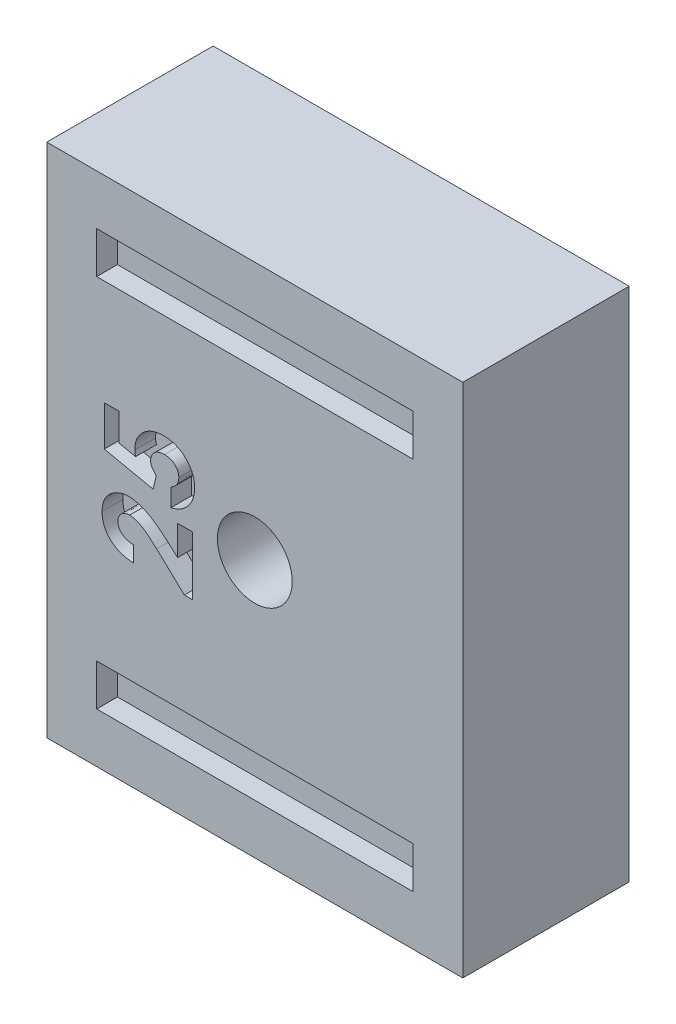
ISO-10303-21;
HEADER;
FILE_DESCRIPTION(('STEP AP214'),'2;1');
FILE_NAME('part.step','',(''),(''),'','','');
FILE_SCHEMA(('AUTOMOTIVE_DESIGN { 1 0 10303 214 1 1 1 1 }'));
ENDSEC;
DATA;
#1=APPLICATION_CONTEXT('core data for automotive mechanical design processes');
#2=APPLICATION_PROTOCOL_DEFINITION('international standard','automotive_design',2000,#1);
#3=PRODUCT_CONTEXT('',#1,'mechanical');
#4=PRODUCT('Part','Part','',(#3));
#5=PRODUCT_RELATED_PRODUCT_CATEGORY('part','',(#4));
#6=PRODUCT_DEFINITION_FORMATION('','',#4);
#7=PRODUCT_DEFINITION_CONTEXT('part definition',#1,'design');
#8=PRODUCT_DEFINITION('design','',#6,#7);
#9=PRODUCT_DEFINITION_SHAPE('','',#8);
#10=(LENGTH_UNIT() NAMED_UNIT(*) SI_UNIT(.MILLI.,.METRE.));
#11=(NAMED_UNIT(*) PLANE_ANGLE_UNIT() SI_UNIT($,.RADIAN.));
#12=(NAMED_UNIT(*) SI_UNIT($,.STERADIAN.) SOLID_ANGLE_UNIT());
#13=UNCERTAINTY_MEASURE_WITH_UNIT(LENGTH_MEASURE(1.E-05),#10,'distance_accuracy_value','');
#14=(GEOMETRIC_REPRESENTATION_CONTEXT(3) GLOBAL_UNCERTAINTY_ASSIGNED_CONTEXT((#13)) GLOBAL_UNIT_ASSIGNED_CONTEXT((#10,
#11,#12)) REPRESENTATION_CONTEXT('',''));
#15=CARTESIAN_POINT('',(0.,0.,0.));
#16=DIRECTION('',(0.,0.,1.));
#17=DIRECTION('',(1.,0.,0.));
#18=AXIS2_PLACEMENT_3D('',#15,#16,#17);
#19=CARTESIAN_POINT('',(0.,0.,8.));
#20=DIRECTION('',(0.,0.,1.));
#21=DIRECTION('',(1.,0.,0.));
#22=AXIS2_PLACEMENT_3D('',#19,#20,#21);
#23=PLANE('',#22);
#24=DIRECTION('',(0.,-1.,0.));
#25=VECTOR('',#24,1.);
#26=CARTESIAN_POINT('',(-9.84541832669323,2.12908366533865,8.));
#27=LINE('',#26,#25);
#28=CARTESIAN_POINT('',(-9.84541832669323,4.12908366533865,8.));
#29=VERTEX_POINT('',#28);
#30=CARTESIAN_POINT('',(-9.84541832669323,2.12908366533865,8.));
#31=VERTEX_POINT('',#30);
#32=EDGE_CURVE('E50',#29,#31,#27,.T.);
#33=ORIENTED_EDGE('',*,*,#32,.F.);
#34=DIRECTION('',(-1.,0.,0.));
#35=VECTOR('',#34,1.);
#36=CARTESIAN_POINT('',(-9.84541832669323,4.12908366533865,8.));
#37=LINE('',#36,#35);
#38=CARTESIAN_POINT('',(5.35458167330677,4.12908366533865,8.));
#39=VERTEX_POINT('',#38);
#40=EDGE_CURVE('E312',#39,#29,#37,.T.);
#41=ORIENTED_EDGE('',*,*,#40,.F.);
#42=DIRECTION('',(0.,1.,0.));
#43=VECTOR('',#42,1.);
#44=CARTESIAN_POINT('',(5.35458167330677,2.12908366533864,8.));
#45=LINE('',#44,#43);
#46=CARTESIAN_POINT('',(5.35458167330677,2.12908366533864,8.));
#47=VERTEX_POINT('',#46);
#48=EDGE_CURVE('E315',#47,#39,#45,.T.);
#49=ORIENTED_EDGE('',*,*,#48,.F.);
#50=DIRECTION('',(1.,0.,0.));
#51=VECTOR('',#50,1.);
#52=CARTESIAN_POINT('',(-9.84541832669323,2.12908366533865,8.));
#53=LINE('',#52,#51);
#54=EDGE_CURVE('E321',#31,#47,#53,.T.);
#55=ORIENTED_EDGE('',*,*,#54,.F.);
#56=EDGE_LOOP('',(#33,#41,#49,#55));
#57=FACE_BOUND('',#56,.T.);
#58=DIRECTION('',(0.,-1.,0.));
#59=VECTOR('',#58,1.);
#60=CARTESIAN_POINT('',(-9.84541832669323,-15.8709163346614,8.));
#61=LINE('',#60,#59);
#62=CARTESIAN_POINT('',(-9.84541832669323,-13.8709163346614,8.));
#63=VERTEX_POINT('',#62);
#64=CARTESIAN_POINT('',(-9.84541832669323,-15.8709163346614,8.));
#65=VERTEX_POINT('',#64);
#66=EDGE_CURVE('E58',#63,#65,#61,.T.);
#67=ORIENTED_EDGE('',*,*,#66,.F.);
#68=DIRECTION('',(-1.,0.,0.));
#69=VECTOR('',#68,1.);
#70=CARTESIAN_POINT('',(-9.84541832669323,-13.8709163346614,8.));
#71=LINE('',#70,#69);
#72=CARTESIAN_POINT('',(5.35458167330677,-13.8709163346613,8.));
#73=VERTEX_POINT('',#72);
#74=EDGE_CURVE('E334',#73,#63,#71,.T.);
#75=ORIENTED_EDGE('',*,*,#74,.F.);
#76=DIRECTION('',(0.,1.,0.));
#77=VECTOR('',#76,1.);
#78=CARTESIAN_POINT('',(5.35458167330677,-15.8709163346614,8.));
#79=LINE('',#78,#77);
#80=CARTESIAN_POINT('',(5.35458167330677,-15.8709163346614,8.));
#81=VERTEX_POINT('',#80);
#82=EDGE_CURVE('E348',#81,#73,#79,.T.);
#83=ORIENTED_EDGE('',*,*,#82,.F.);
#84=DIRECTION('',(1.,0.,0.));
#85=VECTOR('',#84,1.);
#86=CARTESIAN_POINT('',(-9.84541832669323,-15.8709163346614,8.));
#87=LINE('',#86,#85);
#88=EDGE_CURVE('E345',#65,#81,#87,.T.);
#89=ORIENTED_EDGE('',*,*,#88,.F.);
#90=EDGE_LOOP('',(#67,#75,#83,#89));
#91=FACE_BOUND('',#90,.T.);
#92=DIRECTION('',(0.,-1.,0.));
#93=VECTOR('',#92,1.);
#94=CARTESIAN_POINT('',(-12.2454183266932,6.52908366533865,8.));
#95=LINE('',#94,#93);
#96=CARTESIAN_POINT('',(-12.2454183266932,6.52908366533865,8.));
#97=VERTEX_POINT('',#96);
#98=CARTESIAN_POINT('',(-12.2454183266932,-18.2709163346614,8.));
#99=VERTEX_POINT('',#98);
#100=EDGE_CURVE('E545',#97,#99,#95,.T.);
#101=ORIENTED_EDGE('',*,*,#100,.T.);
#102=DIRECTION('',(1.,0.,0.));
#103=VECTOR('',#102,1.);
#104=CARTESIAN_POINT('',(-12.2454183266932,-18.2709163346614,8.));
#105=LINE('',#104,#103);
#106=CARTESIAN_POINT('',(7.75458167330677,-18.2709163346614,8.));
#107=VERTEX_POINT('',#106);
#108=EDGE_CURVE('E548',#99,#107,#105,.T.);
#109=ORIENTED_EDGE('',*,*,#108,.T.);
#110=DIRECTION('',(0.,1.,0.));
#111=VECTOR('',#110,1.);
#112=CARTESIAN_POINT('',(7.75458167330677,6.52908366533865,8.));
#113=LINE('',#112,#111);
#114=CARTESIAN_POINT('',(7.75458167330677,6.52908366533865,8.));
#115=VERTEX_POINT('',#114);
#116=EDGE_CURVE('E551',#107,#115,#113,.T.);
#117=ORIENTED_EDGE('',*,*,#116,.T.);
#118=DIRECTION('',(-1.,0.,0.));
#119=VECTOR('',#118,1.);
#120=CARTESIAN_POINT('',(-12.2454183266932,6.52908366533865,8.));
#121=LINE('',#120,#119);
#122=EDGE_CURVE('E553',#115,#97,#121,.T.);
#123=ORIENTED_EDGE('',*,*,#122,.T.);
#124=EDGE_LOOP('',(#101,#109,#117,#123));
#125=FACE_BOUND('',#124,.T.);
#126=CARTESIAN_POINT('',(-2.24541832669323,-5.87091633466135,8.));
#127=DIRECTION('',(0.,0.,1.));
#128=DIRECTION('',(1.,0.,0.));
#129=AXIS2_PLACEMENT_3D('',#126,#127,#128);
#130=CIRCLE('',#129,1.8);
#131=CARTESIAN_POINT('',(-0.445418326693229,-5.87091633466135,8.));
#132=VERTEX_POINT('',#131);
#133=EDGE_CURVE('E539',#132,#132,#130,.T.);
#134=ORIENTED_EDGE('',*,*,#133,.F.);
#135=EDGE_LOOP('',(#134));
#136=FACE_BOUND('',#135,.T.);
#137=CARTESIAN_POINT('',(-8.2643820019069,-7.01065992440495,8.));
#138=CARTESIAN_POINT('',(-8.3036172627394,-7.01213190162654,8.));
#139=CARTESIAN_POINT('',(-8.37964187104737,-7.01498409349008,8.));
#140=CARTESIAN_POINT('',(-8.48778647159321,-7.04632737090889,8.));
#141=CARTESIAN_POINT('',(-8.58570036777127,-7.09488546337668,8.));
#142=CARTESIAN_POINT('',(-8.67045778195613,-7.16331067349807,8.));
#143=CARTESIAN_POINT('',(-8.74010856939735,-7.2461950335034,8.));
#144=CARTESIAN_POINT('',(-8.79191286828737,-7.34197569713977,8.));
#145=CARTESIAN_POINT('',(-8.82180371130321,-7.44987177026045,8.));
#146=CARTESIAN_POINT('',(-8.82554497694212,-7.52550897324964,8.));
#147=CARTESIAN_POINT('',(-8.82746960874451,-7.56441927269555,8.));
#148=B_SPLINE_CURVE_WITH_KNOTS('',3,(#137,#138,#139,#140,#141,#142,#143,#144,#145,#146,#147),
.UNSPECIFIED.,.F.,.F.,(4,1,1,1,1,1,1,1,4),(0.,0.132754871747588,0.257233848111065,
0.378600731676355,0.501406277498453,0.623941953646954,0.743641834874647,0.868120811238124,1.),.UNSPECIFIED.);
#149=CARTESIAN_POINT('',(-8.2643820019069,-7.01065992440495,8.));
#150=VERTEX_POINT('',#149);
#151=CARTESIAN_POINT('',(-8.82746960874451,-7.56441927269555,8.));
#152=VERTEX_POINT('',#151);
#153=EDGE_CURVE('E499',#150,#152,#148,.T.);
#154=ORIENTED_EDGE('',*,*,#153,.T.);
#155=CARTESIAN_POINT('',(-8.82746960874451,-7.56441927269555,8.));
#156=CARTESIAN_POINT('',(-8.82675862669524,-7.58452082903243,8.));
#157=CARTESIAN_POINT('',(-8.82535894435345,-7.62409397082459,8.));
#158=CARTESIAN_POINT('',(-8.81604163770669,-7.6822633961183,8.));
#159=CARTESIAN_POINT('',(-8.79962085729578,-7.73761578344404,8.));
#160=CARTESIAN_POINT('',(-8.77761932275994,-7.79076723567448,8.));
#161=CARTESIAN_POINT('',(-8.74845613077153,-7.84115050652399,8.));
#162=CARTESIAN_POINT('',(-8.7125078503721,-7.88863851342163,8.));
#163=CARTESIAN_POINT('',(-8.67068800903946,-7.93373160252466,8.));
#164=CARTESIAN_POINT('',(-8.62312737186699,-7.97622295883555,8.));
#165=CARTESIAN_POINT('',(-8.57004968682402,-8.01489564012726,8.));
#166=CARTESIAN_POINT('',(-8.5119397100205,-8.04924457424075,8.));
#167=CARTESIAN_POINT('',(-8.44883351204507,-8.07764542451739,8.));
#168=CARTESIAN_POINT('',(-8.3815641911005,-8.10265056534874,8.));
#169=CARTESIAN_POINT('',(-8.30940921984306,-8.12193572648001,8.));
#170=CARTESIAN_POINT('',(-8.23280043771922,-8.13597771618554,8.));
#171=CARTESIAN_POINT('',(-8.15186247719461,-8.14665290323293,8.));
#172=CARTESIAN_POINT('',(-8.09622524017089,-8.1491305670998,8.));
#173=CARTESIAN_POINT('',(-8.06764054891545,-8.15040351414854,8.));
#174=B_SPLINE_CURVE_WITH_KNOTS('',3,(#155,#156,#157,#158,#159,#160,#161,#162,#163,#164,#165,
#166,#167,#168,#169,#170,#171,#172,#173),.UNSPECIFIED.,.F.,.F.,(4,1,1,1,1,1,1,1,1,1,1,1,1,1,1,1,
4),(0.,0.0564668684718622,0.111164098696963,0.164937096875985,0.218321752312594,
0.272392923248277,0.327976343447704,0.385291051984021,0.444902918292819,0.506843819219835,
0.569488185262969,0.634153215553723,0.700976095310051,0.770897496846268,0.843625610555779,
0.919659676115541,1.),.UNSPECIFIED.);
#175=CARTESIAN_POINT('',(-8.06764054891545,-8.15040351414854,8.));
#176=VERTEX_POINT('',#175);
#177=EDGE_CURVE('E437',#152,#176,#174,.T.);
#178=ORIENTED_EDGE('',*,*,#177,.T.);
#179=DIRECTION('',(0.,-1.,0.));
#180=VECTOR('',#179,1.);
#181=CARTESIAN_POINT('',(-8.06764054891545,-8.15040351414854,8.));
#182=LINE('',#181,#180);
#183=CARTESIAN_POINT('',(-8.06764054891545,-8.9102325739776,8.));
#184=VERTEX_POINT('',#183);
#185=EDGE_CURVE('E445',#176,#184,#182,.T.);
#186=ORIENTED_EDGE('',*,*,#185,.T.);
#187=CARTESIAN_POINT('',(-8.06764054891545,-8.9102325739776,8.));
#188=CARTESIAN_POINT('',(-8.12511819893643,-8.90695227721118,8.));
#189=CARTESIAN_POINT('',(-8.23742607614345,-8.90054277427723,8.));
#190=CARTESIAN_POINT('',(-8.40054677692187,-8.875019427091,8.));
#191=CARTESIAN_POINT('',(-8.55471561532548,-8.84090689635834,8.));
#192=CARTESIAN_POINT('',(-8.69946909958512,-8.79499058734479,8.));
#193=CARTESIAN_POINT('',(-8.83486804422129,-8.73843435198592,8.));
#194=CARTESIAN_POINT('',(-8.9604639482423,-8.66983057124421,8.));
#195=CARTESIAN_POINT('',(-9.07715676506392,-8.59122750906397,8.));
#196=CARTESIAN_POINT('',(-9.18289993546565,-8.50104077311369,8.));
#197=CARTESIAN_POINT('',(-9.27796626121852,-8.40293060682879,8.));
#198=CARTESIAN_POINT('',(-9.36107573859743,-8.29714853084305,8.));
#199=CARTESIAN_POINT('',(-9.43064924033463,-8.18399503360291,8.));
#200=CARTESIAN_POINT('',(-9.48772070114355,-8.0642267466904,8.));
#201=CARTESIAN_POINT('',(-9.53338522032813,-7.93831410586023,8.));
#202=CARTESIAN_POINT('',(-9.56389957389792,-7.80498494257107,8.));
#203=CARTESIAN_POINT('',(-9.58456866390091,-7.66541571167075,8.));
#204=CARTESIAN_POINT('',(-9.58637699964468,-7.5698684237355,8.));
#205=CARTESIAN_POINT('',(-9.58729866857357,-7.5211700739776,8.));
#206=B_SPLINE_CURVE_WITH_KNOTS('',3,(#187,#188,#189,#190,#191,#192,#193,#194,#195,#196,#197,
#198,#199,#200,#201,#202,#203,#204,#205),.UNSPECIFIED.,.F.,.F.,(4,1,1,1,1,1,1,1,1,1,1,1,1,1,1,1,
4),(0.,0.0749330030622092,0.146414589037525,0.214733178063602,0.280395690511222,
0.343911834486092,0.405520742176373,0.466476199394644,0.526809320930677,0.586167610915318,
0.644122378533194,0.70164057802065,0.758775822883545,0.81664635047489,0.875666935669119,
0.936630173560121,1.),.UNSPECIFIED.);
#207=CARTESIAN_POINT('',(-9.58729866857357,-7.5211700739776,8.));
#208=VERTEX_POINT('',#207);
#209=EDGE_CURVE('E452',#184,#208,#206,.T.);
#210=ORIENTED_EDGE('',*,*,#209,.T.);
#211=CARTESIAN_POINT('',(-9.58729866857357,-7.5211700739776,8.));
#212=CARTESIAN_POINT('',(-9.58555886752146,-7.46136669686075,8.));
#213=CARTESIAN_POINT('',(-9.58216087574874,-7.34456519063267,8.));
#214=CARTESIAN_POINT('',(-9.54934431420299,-7.17540747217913,8.));
#215=CARTESIAN_POINT('',(-9.49909112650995,-7.01657804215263,8.));
#216=CARTESIAN_POINT('',(-9.42608017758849,-6.86976639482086,8.));
#217=CARTESIAN_POINT('',(-9.33401278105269,-6.73522778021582,8.));
#218=CARTESIAN_POINT('',(-9.22402377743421,-6.61371018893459,8.));
#219=CARTESIAN_POINT('',(-9.0947769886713,-6.50758359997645,8.));
#220=CARTESIAN_POINT('',(-8.94999439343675,-6.41767567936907,8.));
#221=CARTESIAN_POINT('',(-8.79638380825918,-6.34332656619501,8.));
#222=CARTESIAN_POINT('',(-8.6378341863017,-6.29072577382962,8.));
#223=CARTESIAN_POINT('',(-8.47843762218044,-6.25633401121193,8.));
#224=CARTESIAN_POINT('',(-8.37112074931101,-6.25265736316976,8.));
#225=CARTESIAN_POINT('',(-8.31780748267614,-6.25083086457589,8.));
#226=B_SPLINE_CURVE_WITH_KNOTS('',3,(#211,#212,#213,#214,#215,#216,#217,#218,#219,#220,#221,
#222,#223,#224,#225),.UNSPECIFIED.,.F.,.F.,(4,1,1,1,1,1,1,1,1,1,1,1,4),(0.,0.08961451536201,
0.175025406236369,0.257493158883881,0.338845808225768,0.419998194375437,0.501346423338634,
0.583869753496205,0.669988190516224,0.756473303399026,0.839206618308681,0.920120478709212,1.),.UNSPECIFIED.);
#227=CARTESIAN_POINT('',(-8.31780748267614,-6.25083086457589,8.));
#228=VERTEX_POINT('',#227);
#229=EDGE_CURVE('E457',#208,#228,#226,.T.);
#230=ORIENTED_EDGE('',*,*,#229,.T.);
#231=CARTESIAN_POINT('',(-8.31780748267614,-6.25083086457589,8.));
#232=CARTESIAN_POINT('',(-8.2855592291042,-6.25154109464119,8.));
#233=CARTESIAN_POINT('',(-8.22065146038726,-6.2529706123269,8.));
#234=CARTESIAN_POINT('',(-8.12243007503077,-6.26291023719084,8.));
#235=CARTESIAN_POINT('',(-8.02238011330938,-6.27782164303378,8.));
#236=CARTESIAN_POINT('',(-7.92058734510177,-6.30030439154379,8.));
#237=CARTESIAN_POINT('',(-7.81702328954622,-6.32834228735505,8.));
#238=CARTESIAN_POINT('',(-7.71137780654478,-6.36235605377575,8.));
#239=CARTESIAN_POINT('',(-7.60425068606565,-6.40313587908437,8.));
#240=CARTESIAN_POINT('',(-7.49443300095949,-6.44999651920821,8.));
#241=CARTESIAN_POINT('',(-7.38158116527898,-6.50591716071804,8.00000000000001));
#242=CARTESIAN_POINT('',(-7.26395007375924,-6.57096408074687,8.));
#243=CARTESIAN_POINT('',(-7.14166495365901,-6.64731194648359,8.));
#244=CARTESIAN_POINT('',(-7.0135263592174,-6.73247540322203,8.));
#245=CARTESIAN_POINT('',(-6.8814908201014,-6.82980480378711,8.));
#246=CARTESIAN_POINT('',(-6.74409218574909,-6.93672198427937,8.));
#247=CARTESIAN_POINT('',(-6.60154695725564,-7.05376513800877,8.));
#248=CARTESIAN_POINT('',(-6.50622030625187,-7.13677054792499,8.));
#249=CARTESIAN_POINT('',(-6.45724391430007,-7.17941660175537,8.));
#250=B_SPLINE_CURVE_WITH_KNOTS('',3,(#231,#232,#233,#234,#235,#236,#237,#238,#239,#240,#241,
#242,#243,#244,#245,#246,#247,#248,#249),.UNSPECIFIED.,.F.,.F.,(4,1,1,1,1,1,1,1,1,1,1,1,1,1,1,1,
4),(0.,0.0455173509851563,0.0916151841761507,0.139245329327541,0.188239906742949,
0.238670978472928,0.290661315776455,0.344836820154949,0.400428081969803,0.459139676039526,
0.522546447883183,0.590095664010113,0.662585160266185,0.73968359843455,0.821577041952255,
0.908330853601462,1.),.UNSPECIFIED.);
#251=CARTESIAN_POINT('',(-6.45724391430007,-7.17941660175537,8.));
#252=VERTEX_POINT('',#251);
#253=EDGE_CURVE('E465',#228,#252,#250,.T.);
#254=ORIENTED_EDGE('',*,*,#253,.T.);
#255=DIRECTION('',(0.753436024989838,-0.657521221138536,0.));
#256=VECTOR('',#255,1.);
#257=CARTESIAN_POINT('',(-6.45724391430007,-7.17941660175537,8.));
#258=LINE('',#257,#256);
#259=CARTESIAN_POINT('',(-5.95097388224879,-7.62123684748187,8.));
#260=VERTEX_POINT('',#259);
#261=EDGE_CURVE('E473',#252,#260,#258,.T.);
#262=ORIENTED_EDGE('',*,*,#261,.T.);
#263=DIRECTION('',(0.,1.,0.));
#264=VECTOR('',#263,1.);
#265=CARTESIAN_POINT('',(-5.95097388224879,-7.62123684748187,8.));
#266=LINE('',#265,#264);
#267=CARTESIAN_POINT('',(-5.95097388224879,-6.19655736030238,8.));
#268=VERTEX_POINT('',#267);
#269=EDGE_CURVE('E479',#260,#268,#266,.T.);
#270=ORIENTED_EDGE('',*,*,#269,.T.);
#271=DIRECTION('',(1.,0.,0.));
#272=VECTOR('',#271,1.);
#273=CARTESIAN_POINT('',(-5.95097388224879,-6.19655736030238,8.));
#274=LINE('',#273,#272);
#275=CARTESIAN_POINT('',(-5.24541832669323,-6.19655736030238,8.));
#276=VERTEX_POINT('',#275);
#277=EDGE_CURVE('E482',#268,#276,#274,.T.);
#278=ORIENTED_EDGE('',*,*,#277,.T.);
#279=DIRECTION('',(0.,-1.,0.));
#280=VECTOR('',#279,1.);
#281=CARTESIAN_POINT('',(-5.24541832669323,-6.19655736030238,8.));
#282=LINE('',#281,#280);
#283=CARTESIAN_POINT('',(-5.24541832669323,-9.0187795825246,8.));
#284=VERTEX_POINT('',#283);
#285=EDGE_CURVE('E485',#276,#284,#282,.T.);
#286=ORIENTED_EDGE('',*,*,#285,.T.);
#287=DIRECTION('',(-1.,0.,0.));
#288=VECTOR('',#287,1.);
#289=CARTESIAN_POINT('',(-5.24541832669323,-9.0187795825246,8.));
#290=LINE('',#289,#288);
#291=CARTESIAN_POINT('',(-5.6304209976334,-9.0187795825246,8.));
#292=VERTEX_POINT('',#291);
#293=EDGE_CURVE('E488',#284,#292,#290,.T.);
#294=ORIENTED_EDGE('',*,*,#293,.T.);
#295=DIRECTION('',(-0.728771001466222,0.684757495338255,0.));
#296=VECTOR('',#295,1.);
#297=CARTESIAN_POINT('',(-5.6304209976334,-9.0187795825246,8.));
#298=LINE('',#297,#296);
#299=CARTESIAN_POINT('',(-6.96436196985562,-7.76540084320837,8.));
#300=VERTEX_POINT('',#299);
#301=EDGE_CURVE('E491',#292,#300,#298,.T.);
#302=ORIENTED_EDGE('',*,*,#301,.T.);
#303=CARTESIAN_POINT('',(-6.96436196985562,-7.76540084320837,8.));
#304=CARTESIAN_POINT('',(-7.0032730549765,-7.72911173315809,8.));
#305=CARTESIAN_POINT('',(-7.07863228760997,-7.65883048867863,8.));
#306=CARTESIAN_POINT('',(-7.18931166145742,-7.55883685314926,8.));
#307=CARTESIAN_POINT('',(-7.29432107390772,-7.46831814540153,8.));
#308=CARTESIAN_POINT('',(-7.39487828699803,-7.38929835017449,8.));
#309=CARTESIAN_POINT('',(-7.48757856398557,-7.3169965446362,8.));
#310=CARTESIAN_POINT('',(-7.5759263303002,-7.25651076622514,8.));
#311=CARTESIAN_POINT('',(-7.65743355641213,-7.20383506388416,8.));
#312=CARTESIAN_POINT('',(-7.75678762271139,-7.14880972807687,8.));
#313=CARTESIAN_POINT('',(-7.87439004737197,-7.0953511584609,8.));
#314=CARTESIAN_POINT('',(-8.00978912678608,-7.04633050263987,8.));
#315=CARTESIAN_POINT('',(-8.13929020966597,-7.01674855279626,8.));
#316=CARTESIAN_POINT('',(-8.22382697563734,-7.01263387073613,8.));
#317=CARTESIAN_POINT('',(-8.2643820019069,-7.01065992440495,8.));
#318=B_SPLINE_CURVE_WITH_KNOTS('',3,(#303,#304,#305,#306,#307,#308,#309,#310,#311,#312,#313,
#314,#315,#316,#317),.UNSPECIFIED.,.F.,.F.,(4,1,1,1,1,1,1,1,1,1,1,1,4),(0.,0.103849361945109,
0.201125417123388,0.29113096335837,0.374368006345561,0.450730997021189,0.52052056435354,
0.583275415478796,0.640080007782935,0.742043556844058,0.835051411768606,0.920868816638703,1.),.UNSPECIFIED.);
#319=EDGE_CURVE('E494',#300,#150,#318,.T.);
#320=ORIENTED_EDGE('',*,*,#319,.T.);
#321=EDGE_LOOP('',(#154,#178,#186,#210,#230,#254,#262,#270,#278,#286,#294,#302,#320));
#322=FACE_BOUND('',#321,.T.);
#323=DIRECTION('',(-0.223632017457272,-0.974673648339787,0.));
#324=VECTOR('',#323,1.);
#325=CARTESIAN_POINT('',(-6.98301848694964,-4.72608460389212,8.));
#326=LINE('',#325,#324);
#327=CARTESIAN_POINT('',(-6.98301848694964,-4.72608460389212,8.));
#328=VERTEX_POINT('',#327);
#329=CARTESIAN_POINT('',(-7.12972655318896,-5.36549432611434,8.));
#330=VERTEX_POINT('',#329);
#331=EDGE_CURVE('E365',#328,#330,#326,.T.);
#332=ORIENTED_EDGE('',*,*,#331,.T.);
#333=DIRECTION('',(-0.978275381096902,0.207309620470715,0.));
#334=VECTOR('',#333,1.);
#335=CARTESIAN_POINT('',(-7.12972655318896,-5.36549432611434,8.));
#336=LINE('',#335,#334);
#337=CARTESIAN_POINT('',(-9.47875166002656,-4.8677045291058,8.));
#338=VERTEX_POINT('',#337);
#339=EDGE_CURVE('E355',#330,#338,#336,.T.);
#340=ORIENTED_EDGE('',*,*,#339,.T.);
#341=DIRECTION('',(0.,1.,0.));
#342=VECTOR('',#341,1.);
#343=CARTESIAN_POINT('',(-9.47875166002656,-4.8677045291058,8.));
#344=LINE('',#343,#342);
#345=CARTESIAN_POINT('',(-9.47875166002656,-2.94014710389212,8.));
#346=VERTEX_POINT('',#345);
#347=EDGE_CURVE('E1094',#338,#346,#344,.T.);
#348=ORIENTED_EDGE('',*,*,#347,.T.);
#349=DIRECTION('',(1.,0.,0.));
#350=VECTOR('',#349,1.);
#351=CARTESIAN_POINT('',(-9.47875166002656,-2.94014710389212,8.));
#352=LINE('',#351,#350);
#353=CARTESIAN_POINT('',(-8.77319610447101,-2.94014710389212,8.));
#354=VERTEX_POINT('',#353);
#355=EDGE_CURVE('E1096',#346,#354,#352,.T.);
#356=ORIENTED_EDGE('',*,*,#355,.T.);
#357=DIRECTION('',(0.,-1.,0.));
#358=VECTOR('',#357,1.);
#359=CARTESIAN_POINT('',(-8.77319610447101,-2.94014710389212,8.));
#360=LINE('',#359,#358);
#361=CARTESIAN_POINT('',(-8.77319610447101,-4.26560784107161,8.));
#362=VERTEX_POINT('',#361);
#363=EDGE_CURVE('E1099',#354,#362,#360,.T.);
#364=ORIENTED_EDGE('',*,*,#363,.T.);
#365=DIRECTION('',(0.97932424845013,-0.202296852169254,0.));
#366=VECTOR('',#365,1.);
#367=CARTESIAN_POINT('',(-8.77319610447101,-4.26560784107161,8.));
#368=LINE('',#367,#366);
#369=CARTESIAN_POINT('',(-7.97266191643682,-4.43097242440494,8.));
#370=VERTEX_POINT('',#369);
#371=EDGE_CURVE('E1102',#362,#370,#368,.T.);
#372=ORIENTED_EDGE('',*,*,#371,.T.);
#373=CARTESIAN_POINT('',(-7.97266191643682,-4.43097242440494,8.));
#374=CARTESIAN_POINT('',(-7.97893772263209,-4.40843913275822,8.));
#375=CARTESIAN_POINT('',(-7.99131490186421,-4.36399885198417,8.));
#376=CARTESIAN_POINT('',(-8.00372764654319,-4.29704951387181,8.));
#377=CARTESIAN_POINT('',(-8.01177319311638,-4.23216627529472,8.));
#378=CARTESIAN_POINT('',(-8.01284636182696,-4.18959029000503,8.));
#379=CARTESIAN_POINT('',(-8.01336704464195,-4.16893316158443,8.));
#380=B_SPLINE_CURVE_WITH_KNOTS('',3,(#373,#374,#375,#376,#377,#378,#379),.UNSPECIFIED.,.F.,.F.,
(4,1,1,1,4),(0.,0.2636542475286,0.519980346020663,0.767102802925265,1.),.UNSPECIFIED.);
#381=CARTESIAN_POINT('',(-8.01336704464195,-4.16893316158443,8.));
#382=VERTEX_POINT('',#381);
#383=EDGE_CURVE('E1105',#370,#382,#380,.T.);
#384=ORIENTED_EDGE('',*,*,#383,.T.);
#385=CARTESIAN_POINT('',(-8.01336704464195,-4.16893316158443,8.));
#386=CARTESIAN_POINT('',(-8.01233557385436,-4.12391911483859,8.));
#387=CARTESIAN_POINT('',(-8.01030231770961,-4.03518651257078,8.));
#388=CARTESIAN_POINT('',(-7.99100008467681,-3.9053819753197,8.));
#389=CARTESIAN_POINT('',(-7.96059965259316,-3.78108646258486,8.));
#390=CARTESIAN_POINT('',(-7.91724236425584,-3.66268033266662,8.));
#391=CARTESIAN_POINT('',(-7.86081173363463,-3.55027925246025,8.));
#392=CARTESIAN_POINT('',(-7.79254648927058,-3.44374696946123,8.));
#393=CARTESIAN_POINT('',(-7.71232673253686,-3.34295273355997,8.));
#394=CARTESIAN_POINT('',(-7.62010223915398,-3.24968707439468,8.));
#395=CARTESIAN_POINT('',(-7.51883765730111,-3.1639906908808,8.));
#396=CARTESIAN_POINT('',(-7.40930929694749,-3.08948257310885,8.));
#397=CARTESIAN_POINT('',(-7.29307892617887,-3.02584799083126,8.));
#398=CARTESIAN_POINT('',(-7.1694240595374,-2.97523524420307,8.));
#399=CARTESIAN_POINT('',(-7.03912133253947,-2.93528734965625,8.));
#400=CARTESIAN_POINT('',(-6.9020872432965,-2.90642010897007,8.));
#401=CARTESIAN_POINT('',(-6.7581593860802,-2.88934946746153,8.));
#402=CARTESIAN_POINT('',(-6.65996769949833,-2.88704759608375,8.));
#403=CARTESIAN_POINT('',(-6.6098881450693,-2.88587359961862,8.));
#404=B_SPLINE_CURVE_WITH_KNOTS('',3,(#385,#386,#387,#388,#389,#390,#391,#392,#393,#394,#395,
#396,#397,#398,#399,#400,#401,#402,#403),.UNSPECIFIED.,.F.,.F.,(4,1,1,1,1,1,1,1,1,1,1,1,1,1,1,1,
4),(0.,0.0634005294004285,0.124976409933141,0.184492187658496,0.243473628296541,
0.302263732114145,0.361383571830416,0.421481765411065,0.483454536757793,0.545936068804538,
0.608142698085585,0.66982029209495,0.732332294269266,0.79609223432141,0.861642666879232,
0.929435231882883,1.),.UNSPECIFIED.);
#405=CARTESIAN_POINT('',(-6.6098881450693,-2.88587359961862,8.));
#406=VERTEX_POINT('',#405);
#407=EDGE_CURVE('E1110',#382,#406,#404,.T.);
#408=ORIENTED_EDGE('',*,*,#407,.T.);
#409=CARTESIAN_POINT('',(-6.6098881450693,-2.88587359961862,8.));
#410=CARTESIAN_POINT('',(-6.5592406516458,-2.88730940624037,8.));
#411=CARTESIAN_POINT('',(-6.45929834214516,-2.89014267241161,8.));
#412=CARTESIAN_POINT('',(-6.31233778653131,-2.90859543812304,8.));
#413=CARTESIAN_POINT('',(-6.17162114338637,-2.94125546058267,8.));
#414=CARTESIAN_POINT('',(-6.03683586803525,-2.98572965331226,8.));
#415=CARTESIAN_POINT('',(-5.90914259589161,-3.04549967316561,8.));
#416=CARTESIAN_POINT('',(-5.78617470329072,-3.11535496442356,8.));
#417=CARTESIAN_POINT('',(-5.67057344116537,-3.20036200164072,8.));
#418=CARTESIAN_POINT('',(-5.56199416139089,-3.29641072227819,8.));
#419=CARTESIAN_POINT('',(-5.46268540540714,-3.40125278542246,8.));
#420=CARTESIAN_POINT('',(-5.37555021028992,-3.51315962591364,8.));
#421=CARTESIAN_POINT('',(-5.30093019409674,-3.63025315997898,8.));
#422=CARTESIAN_POINT('',(-5.2417474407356,-3.75419003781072,8.));
#423=CARTESIAN_POINT('',(-5.19468746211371,-3.88307484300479,8.));
#424=CARTESIAN_POINT('',(-5.16050249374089,-4.01735496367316,8.));
#425=CARTESIAN_POINT('',(-5.14088268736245,-4.15760962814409,8.));
#426=CARTESIAN_POINT('',(-5.13822313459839,-4.25282704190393,8.));
#427=CARTESIAN_POINT('',(-5.13687131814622,-4.3012248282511,8.));
#428=B_SPLINE_CURVE_WITH_KNOTS('',3,(#409,#410,#411,#412,#413,#414,#415,#416,#417,#418,#419,
#420,#421,#422,#423,#424,#425,#426,#427),.UNSPECIFIED.,.F.,.F.,(4,1,1,1,1,1,1,1,1,1,1,1,1,1,1,1,
4),(0.,0.066763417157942,0.131743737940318,0.194833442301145,0.256929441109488,
0.318450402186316,0.38038072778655,0.443059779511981,0.507205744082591,0.571256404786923,
0.633119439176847,0.693904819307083,0.753899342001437,0.813779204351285,0.874508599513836,
0.936214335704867,1.),.UNSPECIFIED.);
#429=CARTESIAN_POINT('',(-5.13687131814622,-4.3012248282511,8.));
#430=VERTEX_POINT('',#429);
#431=EDGE_CURVE('E1118',#406,#430,#428,.T.);
#432=ORIENTED_EDGE('',*,*,#431,.T.);
#433=CARTESIAN_POINT('',(-5.13687131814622,-4.3012248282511,8.));
#434=CARTESIAN_POINT('',(-5.13801367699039,-4.3444969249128,8.));
#435=CARTESIAN_POINT('',(-5.14026664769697,-4.42983855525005,8.));
#436=CARTESIAN_POINT('',(-5.15316260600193,-4.555743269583,8.));
#437=CARTESIAN_POINT('',(-5.17877385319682,-4.676495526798,8.));
#438=CARTESIAN_POINT('',(-5.21092803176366,-4.79328588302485,8.));
#439=CARTESIAN_POINT('',(-5.25525075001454,-4.9044996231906,8.));
#440=CARTESIAN_POINT('',(-5.30618486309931,-5.01242847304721,8.));
#441=CARTESIAN_POINT('',(-5.37013167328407,-5.11382340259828,8.));
#442=CARTESIAN_POINT('',(-5.44057839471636,-5.21156499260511,8.));
#443=CARTESIAN_POINT('',(-5.52058407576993,-5.30189573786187,8.));
#444=CARTESIAN_POINT('',(-5.60703785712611,-5.38576520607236,8.));
#445=CARTESIAN_POINT('',(-5.70155579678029,-5.45998306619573,8.));
#446=CARTESIAN_POINT('',(-5.80230082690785,-5.52731441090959,8.));
#447=CARTESIAN_POINT('',(-5.91115406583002,-5.58410092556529,8.));
#448=CARTESIAN_POINT('',(-6.02615747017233,-5.63486477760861,8.));
#449=CARTESIAN_POINT('',(-6.14860554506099,-5.67633587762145,8.));
#450=CARTESIAN_POINT('',(-6.23348165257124,-5.69739418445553,8.));
#451=CARTESIAN_POINT('',(-6.27661490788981,-5.70809582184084,8.));
#452=B_SPLINE_CURVE_WITH_KNOTS('',3,(#433,#434,#435,#436,#437,#438,#439,#440,#441,#442,#443,
#444,#445,#446,#447,#448,#449,#450,#451),.UNSPECIFIED.,.F.,.F.,(4,1,1,1,1,1,1,1,1,1,1,1,1,1,1,1,
4),(0.,0.0659465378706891,0.13006037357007,0.192481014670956,0.253830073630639,
0.314375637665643,0.374667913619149,0.435387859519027,0.496723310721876,0.55806481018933,
0.618986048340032,0.679994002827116,0.740915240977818,0.803340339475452,0.866794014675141,
0.932305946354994,1.),.UNSPECIFIED.);
#453=CARTESIAN_POINT('',(-6.27661490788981,-5.70809582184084,8.));
#454=VERTEX_POINT('',#453);
#455=EDGE_CURVE('E1126',#430,#454,#452,.T.);
#456=ORIENTED_EDGE('',*,*,#455,.T.);
#457=DIRECTION('',(0.,1.,0.));
#458=VECTOR('',#457,1.);
#459=CARTESIAN_POINT('',(-6.27661490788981,-5.70809582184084,8.));
#460=LINE('',#459,#458);
#461=CARTESIAN_POINT('',(-6.27661490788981,-4.83971975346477,8.));
#462=VERTEX_POINT('',#461);
#463=EDGE_CURVE('E1134',#454,#462,#460,.T.);
#464=ORIENTED_EDGE('',*,*,#463,.T.);
#465=CARTESIAN_POINT('',(-6.27661490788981,-4.83971975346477,8.));
#466=CARTESIAN_POINT('',(-6.24671739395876,-4.82385086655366,8.));
#467=CARTESIAN_POINT('',(-6.18861498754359,-4.79301149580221,8.));
#468=CARTESIAN_POINT('',(-6.11159379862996,-4.73425993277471,8.));
#469=CARTESIAN_POINT('',(-6.04558964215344,-4.66893912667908,8.));
#470=CARTESIAN_POINT('',(-5.9918235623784,-4.59598340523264,8.));
#471=CARTESIAN_POINT('',(-5.94921822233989,-4.51781485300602,8.));
#472=CARTESIAN_POINT('',(-5.91825049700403,-4.43482817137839,8.));
#473=CARTESIAN_POINT('',(-5.90008147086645,-4.34752462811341,8.));
#474=CARTESIAN_POINT('',(-5.89783485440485,-4.28802249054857,8.));
#475=CARTESIAN_POINT('',(-5.89670037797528,-4.25797562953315,8.));
#476=B_SPLINE_CURVE_WITH_KNOTS('',3,(#465,#466,#467,#468,#469,#470,#471,#472,#473,#474,#475),
.UNSPECIFIED.,.F.,.F.,(4,1,1,1,1,1,1,1,4),(0.,0.138133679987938,0.268447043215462,
0.394247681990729,0.516475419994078,0.637440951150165,0.756969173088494,0.877276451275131,1.),.UNSPECIFIED.);
#477=CARTESIAN_POINT('',(-5.89670037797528,-4.25797562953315,8.));
#478=VERTEX_POINT('',#477);
#479=EDGE_CURVE('E1140',#462,#478,#476,.T.);
#480=ORIENTED_EDGE('',*,*,#479,.T.);
#481=CARTESIAN_POINT('',(-5.89670037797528,-4.25797562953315,8.));
#482=CARTESIAN_POINT('',(-5.89748822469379,-4.23703597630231,8.));
#483=CARTESIAN_POINT('',(-5.89903832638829,-4.19583685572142,8.));
#484=CARTESIAN_POINT('',(-5.90723875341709,-4.13513646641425,8.));
#485=CARTESIAN_POINT('',(-5.92277017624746,-4.07719527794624,8.));
#486=CARTESIAN_POINT('',(-5.94427758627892,-4.02158251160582,8.));
#487=CARTESIAN_POINT('',(-5.97109975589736,-3.96814877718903,8.));
#488=CARTESIAN_POINT('',(-6.00496099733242,-3.91766006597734,8.));
#489=CARTESIAN_POINT('',(-6.04393654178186,-3.86923796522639,8.));
#490=CARTESIAN_POINT('',(-6.08866111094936,-3.82361965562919,8.));
#491=CARTESIAN_POINT('',(-6.13851860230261,-3.78230261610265,8.));
#492=CARTESIAN_POINT('',(-6.19209387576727,-3.74607209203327,8.));
#493=CARTESIAN_POINT('',(-6.24819647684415,-3.71367700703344,8.));
#494=CARTESIAN_POINT('',(-6.30904877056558,-3.68968147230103,8.));
#495=CARTESIAN_POINT('',(-6.37283368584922,-3.67003115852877,8.));
#496=CARTESIAN_POINT('',(-6.44003237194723,-3.65555987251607,8.));
#497=CARTESIAN_POINT('',(-6.51072331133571,-3.64691164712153,8.));
#498=CARTESIAN_POINT('',(-6.55898203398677,-3.64611105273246,8.));
#499=CARTESIAN_POINT('',(-6.58359941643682,-3.64570265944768,8.));
#500=B_SPLINE_CURVE_WITH_KNOTS('',3,(#481,#482,#483,#484,#485,#486,#487,#488,#489,#490,#491,
#492,#493,#494,#495,#496,#497,#498,#499),.UNSPECIFIED.,.F.,.F.,(4,1,1,1,1,1,1,1,1,1,1,1,1,1,1,1,
4),(0.,0.0611793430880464,0.120371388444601,0.178441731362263,0.235934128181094,
0.294267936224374,0.352654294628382,0.413122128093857,0.475585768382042,0.538900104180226,
0.601869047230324,0.664332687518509,0.727647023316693,0.79240873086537,0.859119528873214,
0.928135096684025,1.),.UNSPECIFIED.);
#501=CARTESIAN_POINT('',(-6.58359941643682,-3.64570265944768,8.));
#502=VERTEX_POINT('',#501);
#503=EDGE_CURVE('E1145',#478,#502,#500,.T.);
#504=ORIENTED_EDGE('',*,*,#503,.T.);
#505=CARTESIAN_POINT('',(-6.58359941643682,-3.64570265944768,8.));
#506=CARTESIAN_POINT('',(-6.60764537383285,-3.64617664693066,8.));
#507=CARTESIAN_POINT('',(-6.65445141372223,-3.64709927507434,8.));
#508=CARTESIAN_POINT('',(-6.72317944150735,-3.65473144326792,8.));
#509=CARTESIAN_POINT('',(-6.78838991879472,-3.66838523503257,8.));
#510=CARTESIAN_POINT('',(-6.85058222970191,-3.68698867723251,8.));
#511=CARTESIAN_POINT('',(-6.9093789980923,-3.7108031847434,8.));
#512=CARTESIAN_POINT('',(-6.96512916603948,-3.7399065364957,8.));
#513=CARTESIAN_POINT('',(-7.01755482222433,-3.77442110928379,8.));
#514=CARTESIAN_POINT('',(-7.06557420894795,-3.81453948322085,8.));
#515=CARTESIAN_POINT('',(-7.10965981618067,-3.85730010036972,8.));
#516=CARTESIAN_POINT('',(-7.14807187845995,-3.90331480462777,8.));
#517=CARTESIAN_POINT('',(-7.18039118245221,-3.95171552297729,8.));
#518=CARTESIAN_POINT('',(-7.20679719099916,-4.00241270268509,8.));
#519=CARTESIAN_POINT('',(-7.22867561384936,-4.05494171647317,8.));
#520=CARTESIAN_POINT('',(-7.24227307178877,-4.11048769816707,8.));
#521=CARTESIAN_POINT('',(-7.25265170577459,-4.16769933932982,8.));
#522=CARTESIAN_POINT('',(-7.2532394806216,-4.20676107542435,8.));
#523=CARTESIAN_POINT('',(-7.25353798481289,-4.22659875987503,8.));
#524=B_SPLINE_CURVE_WITH_KNOTS('',3,(#505,#506,#507,#508,#509,#510,#511,#512,#513,#514,#515,
#516,#517,#518,#519,#520,#521,#522,#523),.UNSPECIFIED.,.F.,.F.,(4,1,1,1,1,1,1,1,1,1,1,1,1,1,1,1,
4),(0.,0.072897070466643,0.141895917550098,0.209300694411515,0.274646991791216,
0.338469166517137,0.401340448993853,0.465047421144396,0.528366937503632,0.5907926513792,
0.651038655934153,0.709753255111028,0.766876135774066,0.824172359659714,0.881756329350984,
0.939949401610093,1.),.UNSPECIFIED.);
#525=CARTESIAN_POINT('',(-7.25353798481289,-4.22659875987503,8.));
#526=VERTEX_POINT('',#525);
#527=EDGE_CURVE('E639',#502,#526,#524,.T.);
#528=ORIENTED_EDGE('',*,*,#527,.T.);
#529=CARTESIAN_POINT('',(-7.25353798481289,-4.22659875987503,8.));
#530=CARTESIAN_POINT('',(-7.25274271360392,-4.24815096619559,8.));
#531=CARTESIAN_POINT('',(-7.2511488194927,-4.29134621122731,8.));
#532=CARTESIAN_POINT('',(-7.23749814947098,-4.35530075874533,8.));
#533=CARTESIAN_POINT('',(-7.2172937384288,-4.41904808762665,8.));
#534=CARTESIAN_POINT('',(-7.18712509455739,-4.48175888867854,8.));
#535=CARTESIAN_POINT('',(-7.14841701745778,-4.54402293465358,8.));
#536=CARTESIAN_POINT('',(-7.10165090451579,-4.6059474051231,8.));
#537=CARTESIAN_POINT('',(-7.04607926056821,-4.66728180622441,8.));
#538=CARTESIAN_POINT('',(-7.00451896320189,-4.70603587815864,8.));
#539=CARTESIAN_POINT('',(-6.98301848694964,-4.72608460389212,8.));
#540=B_SPLINE_CURVE_WITH_KNOTS('',3,(#529,#530,#531,#532,#533,#534,#535,#536,#537,#538,#539),
.UNSPECIFIED.,.F.,.F.,(4,1,1,1,1,1,1,1,4),(0.,0.110314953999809,0.221094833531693,
0.333771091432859,0.452335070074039,0.576541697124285,0.708924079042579,0.84941708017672,1.),.UNSPECIFIED.);
#541=EDGE_CURVE('E634',#526,#328,#540,.T.);
#542=ORIENTED_EDGE('',*,*,#541,.T.);
#543=EDGE_LOOP('',(#332,#340,#348,#356,#364,#372,#384,#408,#432,#456,#464,#480,#504,#528,#542));
#544=FACE_BOUND('',#543,.T.);
#545=ADVANCED_FACE('F35',(#57,#91,#125,#136,#322,#544),#23,.T.);
#546=CARTESIAN_POINT('',(0.,0.,0.));
#547=DIRECTION('',(0.,0.,1.));
#548=DIRECTION('',(1.,0.,0.));
#549=AXIS2_PLACEMENT_3D('',#546,#547,#548);
#550=PLANE('',#549);
#551=DIRECTION('',(0.,-1.,0.));
#552=VECTOR('',#551,1.);
#553=CARTESIAN_POINT('',(-12.2454183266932,6.52908366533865,0.));
#554=LINE('',#553,#552);
#555=CARTESIAN_POINT('',(-12.2454183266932,6.52908366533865,0.));
#556=VERTEX_POINT('',#555);
#557=CARTESIAN_POINT('',(-12.2454183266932,-18.2709163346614,0.));
#558=VERTEX_POINT('',#557);
#559=EDGE_CURVE('E542',#556,#558,#554,.T.);
#560=ORIENTED_EDGE('',*,*,#559,.F.);
#561=DIRECTION('',(-1.,0.,0.));
#562=VECTOR('',#561,1.);
#563=CARTESIAN_POINT('',(-12.2454183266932,6.52908366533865,0.));
#564=LINE('',#563,#562);
#565=CARTESIAN_POINT('',(7.75458167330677,6.52908366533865,0.));
#566=VERTEX_POINT('',#565);
#567=EDGE_CURVE('E549',#566,#556,#564,.T.);
#568=ORIENTED_EDGE('',*,*,#567,.F.);
#569=DIRECTION('',(0.,1.,0.));
#570=VECTOR('',#569,1.);
#571=CARTESIAN_POINT('',(7.75458167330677,6.52908366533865,0.));
#572=LINE('',#571,#570);
#573=CARTESIAN_POINT('',(7.75458167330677,-18.2709163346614,0.));
#574=VERTEX_POINT('',#573);
#575=EDGE_CURVE('E560',#574,#566,#572,.T.);
#576=ORIENTED_EDGE('',*,*,#575,.F.);
#577=DIRECTION('',(1.,0.,0.));
#578=VECTOR('',#577,1.);
#579=CARTESIAN_POINT('',(-12.2454183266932,-18.2709163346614,0.));
#580=LINE('',#579,#578);
#581=EDGE_CURVE('E558',#558,#574,#580,.T.);
#582=ORIENTED_EDGE('',*,*,#581,.F.);
#583=EDGE_LOOP('',(#560,#568,#576,#582));
#584=FACE_BOUND('',#583,.T.);
#585=CARTESIAN_POINT('',(-2.24541832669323,-5.87091633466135,0.));
#586=DIRECTION('',(0.,0.,1.));
#587=DIRECTION('',(1.,0.,0.));
#588=AXIS2_PLACEMENT_3D('',#585,#586,#587);
#589=CIRCLE('',#588,1.8);
#590=CARTESIAN_POINT('',(-0.445418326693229,-5.87091633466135,0.));
#591=VERTEX_POINT('',#590);
#592=EDGE_CURVE('E538',#591,#591,#589,.T.);
#593=ORIENTED_EDGE('',*,*,#592,.T.);
#594=EDGE_LOOP('',(#593));
#595=FACE_BOUND('',#594,.T.);
#596=ADVANCED_FACE('F578',(#584,#595),#550,.F.);
#597=CARTESIAN_POINT('',(-12.2454183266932,6.52908366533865,8.));
#598=DIRECTION('',(1.,0.,0.));
#599=DIRECTION('',(0.,1.,0.));
#600=AXIS2_PLACEMENT_3D('',#597,#598,#599);
#601=PLANE('',#600);
#602=ORIENTED_EDGE('',*,*,#559,.T.);
#603=DIRECTION('',(0.,0.,-1.));
#604=VECTOR('',#603,1.);
#605=CARTESIAN_POINT('',(-12.2454183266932,-18.2709163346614,8.));
#606=LINE('',#605,#604);
#607=EDGE_CURVE('E11',#99,#558,#606,.T.);
#608=ORIENTED_EDGE('',*,*,#607,.F.);
#609=ORIENTED_EDGE('',*,*,#100,.F.);
#610=DIRECTION('',(0.,0.,-1.));
#611=VECTOR('',#610,1.);
#612=CARTESIAN_POINT('',(-12.2454183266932,6.52908366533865,8.));
#613=LINE('',#612,#611);
#614=EDGE_CURVE('E555',#97,#556,#613,.T.);
#615=ORIENTED_EDGE('',*,*,#614,.T.);
#616=EDGE_LOOP('',(#602,#608,#609,#615));
#617=FACE_BOUND('',#616,.T.);
#618=ADVANCED_FACE('F37',(#617),#601,.F.);
#619=CARTESIAN_POINT('',(-12.2454183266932,-18.2709163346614,8.));
#620=DIRECTION('',(0.,1.,0.));
#621=DIRECTION('',(0.,0.,1.));
#622=AXIS2_PLACEMENT_3D('',#619,#620,#621);
#623=PLANE('',#622);
#624=ORIENTED_EDGE('',*,*,#581,.T.);
#625=DIRECTION('',(0.,0.,-1.));
#626=VECTOR('',#625,1.);
#627=CARTESIAN_POINT('',(7.75458167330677,-18.2709163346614,8.));
#628=LINE('',#627,#626);
#629=EDGE_CURVE('E43',#107,#574,#628,.T.);
#630=ORIENTED_EDGE('',*,*,#629,.F.);
#631=ORIENTED_EDGE('',*,*,#108,.F.);
#632=ORIENTED_EDGE('',*,*,#607,.T.);
#633=EDGE_LOOP('',(#624,#630,#631,#632));
#634=FACE_BOUND('',#633,.T.);
#635=ADVANCED_FACE('F589',(#634),#623,.F.);
#636=CARTESIAN_POINT('',(7.75458167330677,6.52908366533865,8.));
#637=DIRECTION('',(-1.,0.,0.));
#638=DIRECTION('',(0.,0.,1.));
#639=AXIS2_PLACEMENT_3D('',#636,#637,#638);
#640=PLANE('',#639);
#641=ORIENTED_EDGE('',*,*,#575,.T.);
#642=DIRECTION('',(0.,0.,-1.));
#643=VECTOR('',#642,1.);
#644=CARTESIAN_POINT('',(7.75458167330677,6.52908366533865,8.));
#645=LINE('',#644,#643);
#646=EDGE_CURVE('E565',#115,#566,#645,.T.);
#647=ORIENTED_EDGE('',*,*,#646,.F.);
#648=ORIENTED_EDGE('',*,*,#116,.F.);
#649=ORIENTED_EDGE('',*,*,#629,.T.);
#650=EDGE_LOOP('',(#641,#647,#648,#649));
#651=FACE_BOUND('',#650,.T.);
#652=ADVANCED_FACE('F572',(#651),#640,.F.);
#653=CARTESIAN_POINT('',(-12.2454183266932,6.52908366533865,8.));
#654=DIRECTION('',(0.,-1.,0.));
#655=DIRECTION('',(0.,0.,-1.));
#656=AXIS2_PLACEMENT_3D('',#653,#654,#655);
#657=PLANE('',#656);
#658=ORIENTED_EDGE('',*,*,#567,.T.);
#659=ORIENTED_EDGE('',*,*,#614,.F.);
#660=ORIENTED_EDGE('',*,*,#122,.F.);
#661=ORIENTED_EDGE('',*,*,#646,.T.);
#662=EDGE_LOOP('',(#658,#659,#660,#661));
#663=FACE_BOUND('',#662,.T.);
#664=ADVANCED_FACE('F582',(#663),#657,.F.);
#665=CARTESIAN_POINT('',(-2.24541832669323,-5.87091633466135,8.));
#666=DIRECTION('',(0.,0.,-1.));
#667=DIRECTION('',(-1.,0.,0.));
#668=AXIS2_PLACEMENT_3D('',#665,#666,#667);
#669=CYLINDRICAL_SURFACE('',#668,1.8);
#670=ORIENTED_EDGE('',*,*,#133,.T.);
#671=EDGE_LOOP('',(#670));
#672=FACE_BOUND('',#671,.T.);
#673=ORIENTED_EDGE('',*,*,#592,.F.);
#674=EDGE_LOOP('',(#673));
#675=FACE_BOUND('',#674,.T.);
#676=ADVANCED_FACE('F607',(#672,#675),#669,.F.);
#677=CARTESIAN_POINT('',(-8.82746960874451,-7.56441927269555,7.));
#678=CARTESIAN_POINT('',(-8.82675862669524,-7.58452082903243,7.));
#679=CARTESIAN_POINT('',(-8.82535894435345,-7.62409397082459,7.));
#680=CARTESIAN_POINT('',(-8.81604163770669,-7.6822633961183,7.));
#681=CARTESIAN_POINT('',(-8.79962085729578,-7.73761578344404,7.));
#682=CARTESIAN_POINT('',(-8.77761932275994,-7.79076723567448,7.));
#683=CARTESIAN_POINT('',(-8.74845613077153,-7.84115050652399,7.));
#684=CARTESIAN_POINT('',(-8.7125078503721,-7.88863851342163,7.));
#685=CARTESIAN_POINT('',(-8.67068800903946,-7.93373160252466,7.));
#686=CARTESIAN_POINT('',(-8.62312737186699,-7.97622295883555,7.));
#687=CARTESIAN_POINT('',(-8.57004968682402,-8.01489564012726,7.));
#688=CARTESIAN_POINT('',(-8.5119397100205,-8.04924457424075,7.));
#689=CARTESIAN_POINT('',(-8.44883351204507,-8.07764542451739,7.));
#690=CARTESIAN_POINT('',(-8.3815641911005,-8.10265056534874,7.));
#691=CARTESIAN_POINT('',(-8.30940921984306,-8.12193572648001,7.));
#692=CARTESIAN_POINT('',(-8.23280043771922,-8.13597771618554,7.));
#693=CARTESIAN_POINT('',(-8.15186247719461,-8.14665290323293,7.));
#694=CARTESIAN_POINT('',(-8.09622524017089,-8.1491305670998,7.));
#695=CARTESIAN_POINT('',(-8.06764054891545,-8.15040351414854,7.));
#696=B_SPLINE_CURVE_WITH_KNOTS('',3,(#677,#678,#679,#680,#681,#682,#683,#684,#685,#686,#687,
#688,#689,#690,#691,#692,#693,#694,#695),.UNSPECIFIED.,.F.,.F.,(4,1,1,1,1,1,1,1,1,1,1,1,1,1,1,1,
4),(0.,0.0564668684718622,0.111164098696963,0.164937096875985,0.218321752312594,
0.272392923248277,0.327976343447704,0.385291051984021,0.444902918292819,0.506843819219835,
0.569488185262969,0.634153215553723,0.700976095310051,0.770897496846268,0.843625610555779,
0.919659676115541,1.),.UNSPECIFIED.);
#697=DIRECTION('',(0.,0.,1.));
#698=VECTOR('',#697,1.);
#699=SURFACE_OF_LINEAR_EXTRUSION('',#696,#698);
#700=ORIENTED_EDGE('',*,*,#177,.F.);
#701=DIRECTION('',(0.,0.,1.));
#702=VECTOR('',#701,1.);
#703=CARTESIAN_POINT('',(-8.82746960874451,-7.56441927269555,7.));
#704=LINE('',#703,#702);
#705=CARTESIAN_POINT('',(-8.82746960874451,-7.56441927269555,7.));
#706=VERTEX_POINT('',#705);
#707=EDGE_CURVE('E431',#706,#152,#704,.T.);
#708=ORIENTED_EDGE('',*,*,#707,.F.);
#709=CARTESIAN_POINT('',(-8.06764054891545,-8.15040351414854,7.));
#710=VERTEX_POINT('',#709);
#711=EDGE_CURVE('E507',#706,#710,#696,.T.);
#712=ORIENTED_EDGE('',*,*,#711,.T.);
#713=DIRECTION('',(0.,0.,1.));
#714=VECTOR('',#713,1.);
#715=CARTESIAN_POINT('',(-8.06764054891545,-8.15040351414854,7.));
#716=LINE('',#715,#714);
#717=EDGE_CURVE('E535',#710,#176,#716,.T.);
#718=ORIENTED_EDGE('',*,*,#717,.T.);
#719=EDGE_LOOP('',(#700,#708,#712,#718));
#720=FACE_BOUND('',#719,.T.);
#721=ADVANCED_FACE('F614',(#720),#699,.T.);
#722=CARTESIAN_POINT('',(-8.06764054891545,-8.15040351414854,7.));
#723=DIRECTION('',(-1.,0.,0.));
#724=DIRECTION('',(0.,0.,1.));
#725=AXIS2_PLACEMENT_3D('',#722,#723,#724);
#726=PLANE('',#725);
#727=ORIENTED_EDGE('',*,*,#185,.F.);
#728=ORIENTED_EDGE('',*,*,#717,.F.);
#729=DIRECTION('',(0.,-1.,0.));
#730=VECTOR('',#729,1.);
#731=CARTESIAN_POINT('',(-8.06764054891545,-8.15040351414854,7.));
#732=LINE('',#731,#730);
#733=CARTESIAN_POINT('',(-8.06764054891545,-8.9102325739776,7.));
#734=VERTEX_POINT('',#733);
#735=EDGE_CURVE('E681',#710,#734,#732,.T.);
#736=ORIENTED_EDGE('',*,*,#735,.T.);
#737=DIRECTION('',(0.,0.,1.));
#738=VECTOR('',#737,1.);
#739=CARTESIAN_POINT('',(-8.06764054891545,-8.9102325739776,7.));
#740=LINE('',#739,#738);
#741=EDGE_CURVE('E533',#734,#184,#740,.T.);
#742=ORIENTED_EDGE('',*,*,#741,.T.);
#743=EDGE_LOOP('',(#727,#728,#736,#742));
#744=FACE_BOUND('',#743,.T.);
#745=ADVANCED_FACE('F619',(#744),#726,.T.);
#746=CARTESIAN_POINT('',(-8.06764054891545,-8.9102325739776,7.));
#747=CARTESIAN_POINT('',(-8.12511819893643,-8.90695227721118,7.));
#748=CARTESIAN_POINT('',(-8.23742607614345,-8.90054277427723,7.));
#749=CARTESIAN_POINT('',(-8.40054677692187,-8.875019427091,7.));
#750=CARTESIAN_POINT('',(-8.55471561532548,-8.84090689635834,7.));
#751=CARTESIAN_POINT('',(-8.69946909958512,-8.79499058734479,7.));
#752=CARTESIAN_POINT('',(-8.83486804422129,-8.73843435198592,7.));
#753=CARTESIAN_POINT('',(-8.9604639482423,-8.66983057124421,7.));
#754=CARTESIAN_POINT('',(-9.07715676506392,-8.59122750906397,7.));
#755=CARTESIAN_POINT('',(-9.18289993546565,-8.50104077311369,7.));
#756=CARTESIAN_POINT('',(-9.27796626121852,-8.40293060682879,7.));
#757=CARTESIAN_POINT('',(-9.36107573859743,-8.29714853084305,7.));
#758=CARTESIAN_POINT('',(-9.43064924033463,-8.18399503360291,7.));
#759=CARTESIAN_POINT('',(-9.48772070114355,-8.0642267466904,7.));
#760=CARTESIAN_POINT('',(-9.53338522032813,-7.93831410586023,7.));
#761=CARTESIAN_POINT('',(-9.56389957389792,-7.80498494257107,7.));
#762=CARTESIAN_POINT('',(-9.58456866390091,-7.66541571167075,7.));
#763=CARTESIAN_POINT('',(-9.58637699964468,-7.5698684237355,7.));
#764=CARTESIAN_POINT('',(-9.58729866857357,-7.5211700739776,7.));
#765=B_SPLINE_CURVE_WITH_KNOTS('',3,(#746,#747,#748,#749,#750,#751,#752,#753,#754,#755,#756,
#757,#758,#759,#760,#761,#762,#763,#764),.UNSPECIFIED.,.F.,.F.,(4,1,1,1,1,1,1,1,1,1,1,1,1,1,1,1,
4),(0.,0.0749330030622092,0.146414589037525,0.214733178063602,0.280395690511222,
0.343911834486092,0.405520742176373,0.466476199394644,0.526809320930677,0.586167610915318,
0.644122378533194,0.70164057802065,0.758775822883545,0.81664635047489,0.875666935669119,
0.936630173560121,1.),.UNSPECIFIED.);
#766=DIRECTION('',(0.,0.,1.));
#767=VECTOR('',#766,1.);
#768=SURFACE_OF_LINEAR_EXTRUSION('',#765,#767);
#769=ORIENTED_EDGE('',*,*,#209,.F.);
#770=ORIENTED_EDGE('',*,*,#741,.F.);
#771=CARTESIAN_POINT('',(-9.58729866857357,-7.5211700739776,7.));
#772=VERTEX_POINT('',#771);
#773=EDGE_CURVE('E697',#734,#772,#765,.T.);
#774=ORIENTED_EDGE('',*,*,#773,.T.);
#775=DIRECTION('',(0.,0.,1.));
#776=VECTOR('',#775,1.);
#777=CARTESIAN_POINT('',(-9.58729866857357,-7.5211700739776,7.));
#778=LINE('',#777,#776);
#779=EDGE_CURVE('E531',#772,#208,#778,.T.);
#780=ORIENTED_EDGE('',*,*,#779,.T.);
#781=EDGE_LOOP('',(#769,#770,#774,#780));
#782=FACE_BOUND('',#781,.T.);
#783=ADVANCED_FACE('F689',(#782),#768,.T.);
#784=CARTESIAN_POINT('',(-9.58729866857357,-7.5211700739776,7.));
#785=CARTESIAN_POINT('',(-9.58555886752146,-7.46136669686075,7.));
#786=CARTESIAN_POINT('',(-9.58216087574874,-7.34456519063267,7.));
#787=CARTESIAN_POINT('',(-9.54934431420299,-7.17540747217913,7.));
#788=CARTESIAN_POINT('',(-9.49909112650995,-7.01657804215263,7.));
#789=CARTESIAN_POINT('',(-9.42608017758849,-6.86976639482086,7.));
#790=CARTESIAN_POINT('',(-9.33401278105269,-6.73522778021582,7.));
#791=CARTESIAN_POINT('',(-9.22402377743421,-6.61371018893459,7.));
#792=CARTESIAN_POINT('',(-9.0947769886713,-6.50758359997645,7.));
#793=CARTESIAN_POINT('',(-8.94999439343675,-6.41767567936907,7.));
#794=CARTESIAN_POINT('',(-8.79638380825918,-6.34332656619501,7.));
#795=CARTESIAN_POINT('',(-8.6378341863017,-6.29072577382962,7.));
#796=CARTESIAN_POINT('',(-8.47843762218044,-6.25633401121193,7.));
#797=CARTESIAN_POINT('',(-8.37112074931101,-6.25265736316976,7.));
#798=CARTESIAN_POINT('',(-8.31780748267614,-6.25083086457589,7.));
#799=B_SPLINE_CURVE_WITH_KNOTS('',3,(#784,#785,#786,#787,#788,#789,#790,#791,#792,#793,#794,
#795,#796,#797,#798),.UNSPECIFIED.,.F.,.F.,(4,1,1,1,1,1,1,1,1,1,1,1,4),(0.,0.08961451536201,
0.175025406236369,0.257493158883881,0.338845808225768,0.419998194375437,0.501346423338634,
0.583869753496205,0.669988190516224,0.756473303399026,0.839206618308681,0.920120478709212,1.),.UNSPECIFIED.);
#800=DIRECTION('',(0.,0.,1.));
#801=VECTOR('',#800,1.);
#802=SURFACE_OF_LINEAR_EXTRUSION('',#799,#801);
#803=ORIENTED_EDGE('',*,*,#229,.F.);
#804=ORIENTED_EDGE('',*,*,#779,.F.);
#805=CARTESIAN_POINT('',(-8.31780748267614,-6.25083086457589,7.));
#806=VERTEX_POINT('',#805);
#807=EDGE_CURVE('E701',#772,#806,#799,.T.);
#808=ORIENTED_EDGE('',*,*,#807,.T.);
#809=DIRECTION('',(0.,0.,1.));
#810=VECTOR('',#809,1.);
#811=CARTESIAN_POINT('',(-8.31780748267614,-6.25083086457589,7.));
#812=LINE('',#811,#810);
#813=EDGE_CURVE('E529',#806,#228,#812,.T.);
#814=ORIENTED_EDGE('',*,*,#813,.T.);
#815=EDGE_LOOP('',(#803,#804,#808,#814));
#816=FACE_BOUND('',#815,.T.);
#817=ADVANCED_FACE('F693',(#816),#802,.T.);
#818=CARTESIAN_POINT('',(-8.31780748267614,-6.25083086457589,7.));
#819=CARTESIAN_POINT('',(-8.2855592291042,-6.25154109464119,7.));
#820=CARTESIAN_POINT('',(-8.22065146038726,-6.2529706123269,7.));
#821=CARTESIAN_POINT('',(-8.12243007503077,-6.26291023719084,7.));
#822=CARTESIAN_POINT('',(-8.02238011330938,-6.27782164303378,7.));
#823=CARTESIAN_POINT('',(-7.92058734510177,-6.30030439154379,7.));
#824=CARTESIAN_POINT('',(-7.81702328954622,-6.32834228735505,7.));
#825=CARTESIAN_POINT('',(-7.71137780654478,-6.36235605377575,7.));
#826=CARTESIAN_POINT('',(-7.60425068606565,-6.40313587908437,7.));
#827=CARTESIAN_POINT('',(-7.49443300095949,-6.44999651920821,7.));
#828=CARTESIAN_POINT('',(-7.38158116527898,-6.50591716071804,7.00000000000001));
#829=CARTESIAN_POINT('',(-7.26395007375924,-6.57096408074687,7.));
#830=CARTESIAN_POINT('',(-7.14166495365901,-6.64731194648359,7.));
#831=CARTESIAN_POINT('',(-7.0135263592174,-6.73247540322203,7.));
#832=CARTESIAN_POINT('',(-6.8814908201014,-6.82980480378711,7.));
#833=CARTESIAN_POINT('',(-6.74409218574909,-6.93672198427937,7.));
#834=CARTESIAN_POINT('',(-6.60154695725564,-7.05376513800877,7.));
#835=CARTESIAN_POINT('',(-6.50622030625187,-7.13677054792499,7.));
#836=CARTESIAN_POINT('',(-6.45724391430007,-7.17941660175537,7.));
#837=B_SPLINE_CURVE_WITH_KNOTS('',3,(#818,#819,#820,#821,#822,#823,#824,#825,#826,#827,#828,
#829,#830,#831,#832,#833,#834,#835,#836),.UNSPECIFIED.,.F.,.F.,(4,1,1,1,1,1,1,1,1,1,1,1,1,1,1,1,
4),(0.,0.0455173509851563,0.0916151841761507,0.139245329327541,0.188239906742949,
0.238670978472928,0.290661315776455,0.344836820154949,0.400428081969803,0.459139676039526,
0.522546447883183,0.590095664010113,0.662585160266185,0.73968359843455,0.821577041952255,
0.908330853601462,1.),.UNSPECIFIED.);
#838=DIRECTION('',(0.,0.,1.));
#839=VECTOR('',#838,1.);
#840=SURFACE_OF_LINEAR_EXTRUSION('',#837,#839);
#841=ORIENTED_EDGE('',*,*,#253,.F.);
#842=ORIENTED_EDGE('',*,*,#813,.F.);
#843=CARTESIAN_POINT('',(-6.45724391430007,-7.17941660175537,7.));
#844=VERTEX_POINT('',#843);
#845=EDGE_CURVE('E709',#806,#844,#837,.T.);
#846=ORIENTED_EDGE('',*,*,#845,.T.);
#847=DIRECTION('',(0.,0.,1.));
#848=VECTOR('',#847,1.);
#849=CARTESIAN_POINT('',(-6.45724391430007,-7.17941660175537,7.));
#850=LINE('',#849,#848);
#851=EDGE_CURVE('E527',#844,#252,#850,.T.);
#852=ORIENTED_EDGE('',*,*,#851,.T.);
#853=EDGE_LOOP('',(#841,#842,#846,#852));
#854=FACE_BOUND('',#853,.T.);
#855=ADVANCED_FACE('F722',(#854),#840,.T.);
#856=CARTESIAN_POINT('',(-6.45724391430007,-7.17941660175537,7.));
#857=DIRECTION('',(-0.657521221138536,-0.753436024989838,0.));
#858=DIRECTION('',(0.753436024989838,-0.657521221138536,0.));
#859=AXIS2_PLACEMENT_3D('',#856,#857,#858);
#860=PLANE('',#859);
#861=ORIENTED_EDGE('',*,*,#261,.F.);
#862=ORIENTED_EDGE('',*,*,#851,.F.);
#863=DIRECTION('',(0.753436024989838,-0.657521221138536,0.));
#864=VECTOR('',#863,1.);
#865=CARTESIAN_POINT('',(-6.45724391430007,-7.17941660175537,7.));
#866=LINE('',#865,#864);
#867=CARTESIAN_POINT('',(-5.95097388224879,-7.62123684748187,7.));
#868=VERTEX_POINT('',#867);
#869=EDGE_CURVE('E717',#844,#868,#866,.T.);
#870=ORIENTED_EDGE('',*,*,#869,.T.);
#871=DIRECTION('',(0.,0.,1.));
#872=VECTOR('',#871,1.);
#873=CARTESIAN_POINT('',(-5.95097388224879,-7.62123684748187,7.));
#874=LINE('',#873,#872);
#875=EDGE_CURVE('E525',#868,#260,#874,.T.);
#876=ORIENTED_EDGE('',*,*,#875,.T.);
#877=EDGE_LOOP('',(#861,#862,#870,#876));
#878=FACE_BOUND('',#877,.T.);
#879=ADVANCED_FACE('F725',(#878),#860,.T.);
#880=CARTESIAN_POINT('',(-5.95097388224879,-7.62123684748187,7.));
#881=DIRECTION('',(1.,0.,0.));
#882=DIRECTION('',(0.,0.,-1.));
#883=AXIS2_PLACEMENT_3D('',#880,#881,#882);
#884=PLANE('',#883);
#885=ORIENTED_EDGE('',*,*,#269,.F.);
#886=ORIENTED_EDGE('',*,*,#875,.F.);
#887=DIRECTION('',(0.,1.,0.));
#888=VECTOR('',#887,1.);
#889=CARTESIAN_POINT('',(-5.95097388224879,-7.62123684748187,7.));
#890=LINE('',#889,#888);
#891=CARTESIAN_POINT('',(-5.95097388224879,-6.19655736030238,7.));
#892=VERTEX_POINT('',#891);
#893=EDGE_CURVE('E769',#868,#892,#890,.T.);
#894=ORIENTED_EDGE('',*,*,#893,.T.);
#895=DIRECTION('',(0.,0.,1.));
#896=VECTOR('',#895,1.);
#897=CARTESIAN_POINT('',(-5.95097388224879,-6.19655736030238,7.));
#898=LINE('',#897,#896);
#899=EDGE_CURVE('E523',#892,#268,#898,.T.);
#900=ORIENTED_EDGE('',*,*,#899,.T.);
#901=EDGE_LOOP('',(#885,#886,#894,#900));
#902=FACE_BOUND('',#901,.T.);
#903=ADVANCED_FACE('F729',(#902),#884,.T.);
#904=CARTESIAN_POINT('',(-5.95097388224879,-6.19655736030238,7.));
#905=DIRECTION('',(0.,-1.,0.));
#906=DIRECTION('',(0.,0.,-1.));
#907=AXIS2_PLACEMENT_3D('',#904,#905,#906);
#908=PLANE('',#907);
#909=ORIENTED_EDGE('',*,*,#277,.F.);
#910=ORIENTED_EDGE('',*,*,#899,.F.);
#911=DIRECTION('',(1.,0.,0.));
#912=VECTOR('',#911,1.);
#913=CARTESIAN_POINT('',(-5.95097388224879,-6.19655736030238,7.));
#914=LINE('',#913,#912);
#915=CARTESIAN_POINT('',(-5.24541832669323,-6.19655736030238,7.));
#916=VERTEX_POINT('',#915);
#917=EDGE_CURVE('E766',#892,#916,#914,.T.);
#918=ORIENTED_EDGE('',*,*,#917,.T.);
#919=DIRECTION('',(0.,0.,1.));
#920=VECTOR('',#919,1.);
#921=CARTESIAN_POINT('',(-5.24541832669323,-6.19655736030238,7.));
#922=LINE('',#921,#920);
#923=EDGE_CURVE('E521',#916,#276,#922,.T.);
#924=ORIENTED_EDGE('',*,*,#923,.T.);
#925=EDGE_LOOP('',(#909,#910,#918,#924));
#926=FACE_BOUND('',#925,.T.);
#927=ADVANCED_FACE('F733',(#926),#908,.T.);
#928=CARTESIAN_POINT('',(-5.24541832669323,-6.19655736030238,7.));
#929=DIRECTION('',(-1.,0.,0.));
#930=DIRECTION('',(0.,0.,1.));
#931=AXIS2_PLACEMENT_3D('',#928,#929,#930);
#932=PLANE('',#931);
#933=ORIENTED_EDGE('',*,*,#285,.F.);
#934=ORIENTED_EDGE('',*,*,#923,.F.);
#935=DIRECTION('',(0.,-1.,0.));
#936=VECTOR('',#935,1.);
#937=CARTESIAN_POINT('',(-5.24541832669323,-6.19655736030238,7.));
#938=LINE('',#937,#936);
#939=CARTESIAN_POINT('',(-5.24541832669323,-9.0187795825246,7.));
#940=VERTEX_POINT('',#939);
#941=EDGE_CURVE('E764',#916,#940,#938,.T.);
#942=ORIENTED_EDGE('',*,*,#941,.T.);
#943=DIRECTION('',(0.,0.,1.));
#944=VECTOR('',#943,1.);
#945=CARTESIAN_POINT('',(-5.24541832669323,-9.0187795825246,7.));
#946=LINE('',#945,#944);
#947=EDGE_CURVE('E519',#940,#284,#946,.T.);
#948=ORIENTED_EDGE('',*,*,#947,.T.);
#949=EDGE_LOOP('',(#933,#934,#942,#948));
#950=FACE_BOUND('',#949,.T.);
#951=ADVANCED_FACE('F737',(#950),#932,.T.);
#952=CARTESIAN_POINT('',(-5.24541832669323,-9.0187795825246,7.));
#953=DIRECTION('',(0.,1.,0.));
#954=DIRECTION('',(0.,0.,1.));
#955=AXIS2_PLACEMENT_3D('',#952,#953,#954);
#956=PLANE('',#955);
#957=ORIENTED_EDGE('',*,*,#293,.F.);
#958=ORIENTED_EDGE('',*,*,#947,.F.);
#959=DIRECTION('',(-1.,0.,0.));
#960=VECTOR('',#959,1.);
#961=CARTESIAN_POINT('',(-5.24541832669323,-9.0187795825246,7.));
#962=LINE('',#961,#960);
#963=CARTESIAN_POINT('',(-5.6304209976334,-9.0187795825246,7.));
#964=VERTEX_POINT('',#963);
#965=EDGE_CURVE('E761',#940,#964,#962,.T.);
#966=ORIENTED_EDGE('',*,*,#965,.T.);
#967=DIRECTION('',(0.,0.,1.));
#968=VECTOR('',#967,1.);
#969=CARTESIAN_POINT('',(-5.6304209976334,-9.0187795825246,7.));
#970=LINE('',#969,#968);
#971=EDGE_CURVE('E517',#964,#292,#970,.T.);
#972=ORIENTED_EDGE('',*,*,#971,.T.);
#973=EDGE_LOOP('',(#957,#958,#966,#972));
#974=FACE_BOUND('',#973,.T.);
#975=ADVANCED_FACE('F741',(#974),#956,.T.);
#976=CARTESIAN_POINT('',(-5.6304209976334,-9.0187795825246,7.));
#977=DIRECTION('',(0.684757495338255,0.728771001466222,0.));
#978=DIRECTION('',(-0.728771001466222,0.684757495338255,0.));
#979=AXIS2_PLACEMENT_3D('',#976,#977,#978);
#980=PLANE('',#979);
#981=ORIENTED_EDGE('',*,*,#301,.F.);
#982=ORIENTED_EDGE('',*,*,#971,.F.);
#983=DIRECTION('',(-0.728771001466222,0.684757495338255,0.));
#984=VECTOR('',#983,1.);
#985=CARTESIAN_POINT('',(-5.6304209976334,-9.0187795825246,7.));
#986=LINE('',#985,#984);
#987=CARTESIAN_POINT('',(-6.96436196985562,-7.76540084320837,7.));
#988=VERTEX_POINT('',#987);
#989=EDGE_CURVE('E763',#964,#988,#986,.T.);
#990=ORIENTED_EDGE('',*,*,#989,.T.);
#991=DIRECTION('',(0.,0.,1.));
#992=VECTOR('',#991,1.);
#993=CARTESIAN_POINT('',(-6.96436196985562,-7.76540084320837,7.));
#994=LINE('',#993,#992);
#995=EDGE_CURVE('E515',#988,#300,#994,.T.);
#996=ORIENTED_EDGE('',*,*,#995,.T.);
#997=EDGE_LOOP('',(#981,#982,#990,#996));
#998=FACE_BOUND('',#997,.T.);
#999=ADVANCED_FACE('F744',(#998),#980,.T.);
#1000=CARTESIAN_POINT('',(-6.96436196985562,-7.76540084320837,7.));
#1001=CARTESIAN_POINT('',(-7.0032730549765,-7.72911173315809,7.));
#1002=CARTESIAN_POINT('',(-7.07863228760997,-7.65883048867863,7.));
#1003=CARTESIAN_POINT('',(-7.18931166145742,-7.55883685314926,7.));
#1004=CARTESIAN_POINT('',(-7.29432107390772,-7.46831814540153,7.));
#1005=CARTESIAN_POINT('',(-7.39487828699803,-7.38929835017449,7.));
#1006=CARTESIAN_POINT('',(-7.48757856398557,-7.3169965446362,7.));
#1007=CARTESIAN_POINT('',(-7.5759263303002,-7.25651076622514,7.));
#1008=CARTESIAN_POINT('',(-7.65743355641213,-7.20383506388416,7.));
#1009=CARTESIAN_POINT('',(-7.75678762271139,-7.14880972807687,7.));
#1010=CARTESIAN_POINT('',(-7.87439004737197,-7.0953511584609,7.));
#1011=CARTESIAN_POINT('',(-8.00978912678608,-7.04633050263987,7.));
#1012=CARTESIAN_POINT('',(-8.13929020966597,-7.01674855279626,7.));
#1013=CARTESIAN_POINT('',(-8.22382697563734,-7.01263387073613,7.));
#1014=CARTESIAN_POINT('',(-8.2643820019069,-7.01065992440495,7.));
#1015=B_SPLINE_CURVE_WITH_KNOTS('',3,(#1000,#1001,#1002,#1003,#1004,#1005,#1006,#1007,#1008,
#1009,#1010,#1011,#1012,#1013,#1014),.UNSPECIFIED.,.F.,.F.,(4,1,1,1,1,1,1,1,1,1,1,1,4),(0.,
0.103849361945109,0.201125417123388,0.29113096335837,0.374368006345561,0.450730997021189,
0.52052056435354,0.583275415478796,0.640080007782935,0.742043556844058,0.835051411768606,
0.920868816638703,1.),.UNSPECIFIED.);
#1016=DIRECTION('',(0.,0.,1.));
#1017=VECTOR('',#1016,1.);
#1018=SURFACE_OF_LINEAR_EXTRUSION('',#1015,#1017);
#1019=ORIENTED_EDGE('',*,*,#319,.F.);
#1020=ORIENTED_EDGE('',*,*,#995,.F.);
#1021=CARTESIAN_POINT('',(-8.2643820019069,-7.01065992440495,7.));
#1022=VERTEX_POINT('',#1021);
#1023=EDGE_CURVE('E432',#988,#1022,#1015,.T.);
#1024=ORIENTED_EDGE('',*,*,#1023,.T.);
#1025=DIRECTION('',(0.,0.,1.));
#1026=VECTOR('',#1025,1.);
#1027=CARTESIAN_POINT('',(-8.2643820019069,-7.01065992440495,7.));
#1028=LINE('',#1027,#1026);
#1029=EDGE_CURVE('E513',#1022,#150,#1028,.T.);
#1030=ORIENTED_EDGE('',*,*,#1029,.T.);
#1031=EDGE_LOOP('',(#1019,#1020,#1024,#1030));
#1032=FACE_BOUND('',#1031,.T.);
#1033=ADVANCED_FACE('F422',(#1032),#1018,.T.);
#1034=CARTESIAN_POINT('',(-8.2643820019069,-7.01065992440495,7.));
#1035=CARTESIAN_POINT('',(-8.3036172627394,-7.01213190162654,7.));
#1036=CARTESIAN_POINT('',(-8.37964187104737,-7.01498409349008,7.));
#1037=CARTESIAN_POINT('',(-8.48778647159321,-7.04632737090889,7.));
#1038=CARTESIAN_POINT('',(-8.58570036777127,-7.09488546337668,7.));
#1039=CARTESIAN_POINT('',(-8.67045778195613,-7.16331067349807,7.));
#1040=CARTESIAN_POINT('',(-8.74010856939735,-7.2461950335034,7.));
#1041=CARTESIAN_POINT('',(-8.79191286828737,-7.34197569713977,7.));
#1042=CARTESIAN_POINT('',(-8.82180371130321,-7.44987177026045,7.));
#1043=CARTESIAN_POINT('',(-8.82554497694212,-7.52550897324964,7.));
#1044=CARTESIAN_POINT('',(-8.82746960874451,-7.56441927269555,7.));
#1045=B_SPLINE_CURVE_WITH_KNOTS('',3,(#1034,#1035,#1036,#1037,#1038,#1039,#1040,#1041,#1042,
#1043,#1044),.UNSPECIFIED.,.F.,.F.,(4,1,1,1,1,1,1,1,4),(0.,0.132754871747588,0.257233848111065,
0.378600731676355,0.501406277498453,0.623941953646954,0.743641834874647,0.868120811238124,1.),.UNSPECIFIED.);
#1046=DIRECTION('',(0.,0.,1.));
#1047=VECTOR('',#1046,1.);
#1048=SURFACE_OF_LINEAR_EXTRUSION('',#1045,#1047);
#1049=ORIENTED_EDGE('',*,*,#153,.F.);
#1050=ORIENTED_EDGE('',*,*,#1029,.F.);
#1051=EDGE_CURVE('E426',#1022,#706,#1045,.T.);
#1052=ORIENTED_EDGE('',*,*,#1051,.T.);
#1053=ORIENTED_EDGE('',*,*,#707,.T.);
#1054=EDGE_LOOP('',(#1049,#1050,#1052,#1053));
#1055=FACE_BOUND('',#1054,.T.);
#1056=ADVANCED_FACE('F417',(#1055),#1048,.T.);
#1057=CARTESIAN_POINT('',(-8.57575816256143,-8.00981944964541,7.));
#1058=DIRECTION('',(0.,0.,-1.));
#1059=DIRECTION('',(-1.,0.,0.));
#1060=AXIS2_PLACEMENT_3D('',#1057,#1058,#1059);
#1061=PLANE('',#1060);
#1062=ORIENTED_EDGE('',*,*,#711,.F.);
#1063=ORIENTED_EDGE('',*,*,#1051,.F.);
#1064=ORIENTED_EDGE('',*,*,#1023,.F.);
#1065=ORIENTED_EDGE('',*,*,#989,.F.);
#1066=ORIENTED_EDGE('',*,*,#965,.F.);
#1067=ORIENTED_EDGE('',*,*,#941,.F.);
#1068=ORIENTED_EDGE('',*,*,#917,.F.);
#1069=ORIENTED_EDGE('',*,*,#893,.F.);
#1070=ORIENTED_EDGE('',*,*,#869,.F.);
#1071=ORIENTED_EDGE('',*,*,#845,.F.);
#1072=ORIENTED_EDGE('',*,*,#807,.F.);
#1073=ORIENTED_EDGE('',*,*,#773,.F.);
#1074=ORIENTED_EDGE('',*,*,#735,.F.);
#1075=EDGE_LOOP('',(#1062,#1063,#1064,#1065,#1066,#1067,#1068,#1069,#1070,#1071,#1072,#1073,#1074));
#1076=FACE_BOUND('',#1075,.T.);
#1077=ADVANCED_FACE('F413',(#1076),#1061,.F.);
#1078=CARTESIAN_POINT('',(-7.12972655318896,-5.36549432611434,7.));
#1079=DIRECTION('',(0.207309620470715,0.978275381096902,0.));
#1080=DIRECTION('',(-0.978275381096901,0.207309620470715,0.));
#1081=AXIS2_PLACEMENT_3D('',#1078,#1079,#1080);
#1082=PLANE('',#1081);
#1083=ORIENTED_EDGE('',*,*,#339,.F.);
#1084=DIRECTION('',(0.,0.,1.));
#1085=VECTOR('',#1084,1.);
#1086=CARTESIAN_POINT('',(-7.12972655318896,-5.36549432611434,7.));
#1087=LINE('',#1086,#1085);
#1088=CARTESIAN_POINT('',(-7.12972655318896,-5.36549432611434,7.));
#1089=VERTEX_POINT('',#1088);
#1090=EDGE_CURVE('E645',#1089,#330,#1087,.T.);
#1091=ORIENTED_EDGE('',*,*,#1090,.F.);
#1092=DIRECTION('',(-0.978275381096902,0.207309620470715,0.));
#1093=VECTOR('',#1092,1.);
#1094=CARTESIAN_POINT('',(-7.12972655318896,-5.36549432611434,7.));
#1095=LINE('',#1094,#1093);
#1096=CARTESIAN_POINT('',(-9.47875166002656,-4.8677045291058,7.));
#1097=VERTEX_POINT('',#1096);
#1098=EDGE_CURVE('E361',#1089,#1097,#1095,.T.);
#1099=ORIENTED_EDGE('',*,*,#1098,.T.);
#1100=DIRECTION('',(0.,0.,1.));
#1101=VECTOR('',#1100,1.);
#1102=CARTESIAN_POINT('',(-9.47875166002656,-4.8677045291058,7.));
#1103=LINE('',#1102,#1101);
#1104=EDGE_CURVE('E446',#1097,#338,#1103,.T.);
#1105=ORIENTED_EDGE('',*,*,#1104,.T.);
#1106=EDGE_LOOP('',(#1083,#1091,#1099,#1105));
#1107=FACE_BOUND('',#1106,.T.);
#1108=ADVANCED_FACE('F409',(#1107),#1082,.T.);
#1109=CARTESIAN_POINT('',(-9.47875166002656,-4.8677045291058,7.));
#1110=DIRECTION('',(1.,0.,0.));
#1111=DIRECTION('',(0.,0.,-1.));
#1112=AXIS2_PLACEMENT_3D('',#1109,#1110,#1111);
#1113=PLANE('',#1112);
#1114=ORIENTED_EDGE('',*,*,#347,.F.);
#1115=ORIENTED_EDGE('',*,*,#1104,.F.);
#1116=DIRECTION('',(0.,1.,0.));
#1117=VECTOR('',#1116,1.);
#1118=CARTESIAN_POINT('',(-9.47875166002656,-4.8677045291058,7.));
#1119=LINE('',#1118,#1117);
#1120=CARTESIAN_POINT('',(-9.47875166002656,-2.94014710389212,7.));
#1121=VERTEX_POINT('',#1120);
#1122=EDGE_CURVE('E364',#1097,#1121,#1119,.T.);
#1123=ORIENTED_EDGE('',*,*,#1122,.T.);
#1124=DIRECTION('',(0.,0.,1.));
#1125=VECTOR('',#1124,1.);
#1126=CARTESIAN_POINT('',(-9.47875166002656,-2.94014710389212,7.));
#1127=LINE('',#1126,#1125);
#1128=EDGE_CURVE('E672',#1121,#346,#1127,.T.);
#1129=ORIENTED_EDGE('',*,*,#1128,.T.);
#1130=EDGE_LOOP('',(#1114,#1115,#1123,#1129));
#1131=FACE_BOUND('',#1130,.T.);
#1132=ADVANCED_FACE('F405',(#1131),#1113,.T.);
#1133=CARTESIAN_POINT('',(-9.47875166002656,-2.94014710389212,7.));
#1134=DIRECTION('',(0.,-1.,0.));
#1135=DIRECTION('',(0.,0.,-1.));
#1136=AXIS2_PLACEMENT_3D('',#1133,#1134,#1135);
#1137=PLANE('',#1136);
#1138=ORIENTED_EDGE('',*,*,#355,.F.);
#1139=ORIENTED_EDGE('',*,*,#1128,.F.);
#1140=DIRECTION('',(1.,0.,0.));
#1141=VECTOR('',#1140,1.);
#1142=CARTESIAN_POINT('',(-9.47875166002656,-2.94014710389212,7.));
#1143=LINE('',#1142,#1141);
#1144=CARTESIAN_POINT('',(-8.77319610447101,-2.94014710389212,7.));
#1145=VERTEX_POINT('',#1144);
#1146=EDGE_CURVE('E367',#1121,#1145,#1143,.T.);
#1147=ORIENTED_EDGE('',*,*,#1146,.T.);
#1148=DIRECTION('',(0.,0.,1.));
#1149=VECTOR('',#1148,1.);
#1150=CARTESIAN_POINT('',(-8.77319610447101,-2.94014710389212,7.));
#1151=LINE('',#1150,#1149);
#1152=EDGE_CURVE('E670',#1145,#354,#1151,.T.);
#1153=ORIENTED_EDGE('',*,*,#1152,.T.);
#1154=EDGE_LOOP('',(#1138,#1139,#1147,#1153));
#1155=FACE_BOUND('',#1154,.T.);
#1156=ADVANCED_FACE('F401',(#1155),#1137,.T.);
#1157=CARTESIAN_POINT('',(-8.77319610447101,-2.94014710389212,7.));
#1158=DIRECTION('',(-1.,0.,0.));
#1159=DIRECTION('',(0.,0.,1.));
#1160=AXIS2_PLACEMENT_3D('',#1157,#1158,#1159);
#1161=PLANE('',#1160);
#1162=ORIENTED_EDGE('',*,*,#363,.F.);
#1163=ORIENTED_EDGE('',*,*,#1152,.F.);
#1164=DIRECTION('',(0.,-1.,0.));
#1165=VECTOR('',#1164,1.);
#1166=CARTESIAN_POINT('',(-8.77319610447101,-2.94014710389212,7.));
#1167=LINE('',#1166,#1165);
#1168=CARTESIAN_POINT('',(-8.77319610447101,-4.26560784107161,7.));
#1169=VERTEX_POINT('',#1168);
#1170=EDGE_CURVE('E369',#1145,#1169,#1167,.T.);
#1171=ORIENTED_EDGE('',*,*,#1170,.T.);
#1172=DIRECTION('',(0.,0.,1.));
#1173=VECTOR('',#1172,1.);
#1174=CARTESIAN_POINT('',(-8.77319610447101,-4.26560784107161,7.));
#1175=LINE('',#1174,#1173);
#1176=EDGE_CURVE('E668',#1169,#362,#1175,.T.);
#1177=ORIENTED_EDGE('',*,*,#1176,.T.);
#1178=EDGE_LOOP('',(#1162,#1163,#1171,#1177));
#1179=FACE_BOUND('',#1178,.T.);
#1180=ADVANCED_FACE('F397',(#1179),#1161,.T.);
#1181=CARTESIAN_POINT('',(-8.77319610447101,-4.26560784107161,7.));
#1182=DIRECTION('',(-0.202296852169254,-0.97932424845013,0.));
#1183=DIRECTION('',(0.97932424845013,-0.202296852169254,0.));
#1184=AXIS2_PLACEMENT_3D('',#1181,#1182,#1183);
#1185=PLANE('',#1184);
#1186=ORIENTED_EDGE('',*,*,#371,.F.);
#1187=ORIENTED_EDGE('',*,*,#1176,.F.);
#1188=DIRECTION('',(0.97932424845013,-0.202296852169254,0.));
#1189=VECTOR('',#1188,1.);
#1190=CARTESIAN_POINT('',(-8.77319610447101,-4.26560784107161,7.));
#1191=LINE('',#1190,#1189);
#1192=CARTESIAN_POINT('',(-7.97266191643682,-4.43097242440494,7.));
#1193=VERTEX_POINT('',#1192);
#1194=EDGE_CURVE('E371',#1169,#1193,#1191,.T.);
#1195=ORIENTED_EDGE('',*,*,#1194,.T.);
#1196=DIRECTION('',(0.,0.,1.));
#1197=VECTOR('',#1196,1.);
#1198=CARTESIAN_POINT('',(-7.97266191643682,-4.43097242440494,7.));
#1199=LINE('',#1198,#1197);
#1200=EDGE_CURVE('E666',#1193,#370,#1199,.T.);
#1201=ORIENTED_EDGE('',*,*,#1200,.T.);
#1202=EDGE_LOOP('',(#1186,#1187,#1195,#1201));
#1203=FACE_BOUND('',#1202,.T.);
#1204=ADVANCED_FACE('F392',(#1203),#1185,.T.);
#1205=CARTESIAN_POINT('',(-7.97266191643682,-4.43097242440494,7.));
#1206=CARTESIAN_POINT('',(-7.97893772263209,-4.40843913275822,7.));
#1207=CARTESIAN_POINT('',(-7.99131490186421,-4.36399885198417,7.));
#1208=CARTESIAN_POINT('',(-8.00372764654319,-4.29704951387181,7.));
#1209=CARTESIAN_POINT('',(-8.01177319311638,-4.23216627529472,7.));
#1210=CARTESIAN_POINT('',(-8.01284636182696,-4.18959029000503,7.));
#1211=CARTESIAN_POINT('',(-8.01336704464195,-4.16893316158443,7.));
#1212=B_SPLINE_CURVE_WITH_KNOTS('',3,(#1205,#1206,#1207,#1208,#1209,#1210,#1211),.UNSPECIFIED.,
.F.,.F.,(4,1,1,1,4),(0.,0.2636542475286,0.519980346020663,0.767102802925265,1.),.UNSPECIFIED.);
#1213=DIRECTION('',(0.,0.,1.));
#1214=VECTOR('',#1213,1.);
#1215=SURFACE_OF_LINEAR_EXTRUSION('',#1212,#1214);
#1216=ORIENTED_EDGE('',*,*,#383,.F.);
#1217=ORIENTED_EDGE('',*,*,#1200,.F.);
#1218=CARTESIAN_POINT('',(-8.01336704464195,-4.16893316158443,7.));
#1219=VERTEX_POINT('',#1218);
#1220=EDGE_CURVE('E373',#1193,#1219,#1212,.T.);
#1221=ORIENTED_EDGE('',*,*,#1220,.T.);
#1222=DIRECTION('',(0.,0.,1.));
#1223=VECTOR('',#1222,1.);
#1224=CARTESIAN_POINT('',(-8.01336704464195,-4.16893316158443,7.));
#1225=LINE('',#1224,#1223);
#1226=EDGE_CURVE('E664',#1219,#382,#1225,.T.);
#1227=ORIENTED_EDGE('',*,*,#1226,.T.);
#1228=EDGE_LOOP('',(#1216,#1217,#1221,#1227));
#1229=FACE_BOUND('',#1228,.T.);
#1230=ADVANCED_FACE('F387',(#1229),#1215,.T.);
#1231=CARTESIAN_POINT('',(-8.01336704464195,-4.16893316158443,7.));
#1232=CARTESIAN_POINT('',(-8.01233557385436,-4.12391911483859,7.));
#1233=CARTESIAN_POINT('',(-8.01030231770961,-4.03518651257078,7.));
#1234=CARTESIAN_POINT('',(-7.99100008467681,-3.9053819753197,7.));
#1235=CARTESIAN_POINT('',(-7.96059965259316,-3.78108646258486,7.));
#1236=CARTESIAN_POINT('',(-7.91724236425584,-3.66268033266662,7.));
#1237=CARTESIAN_POINT('',(-7.86081173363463,-3.55027925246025,7.));
#1238=CARTESIAN_POINT('',(-7.79254648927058,-3.44374696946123,7.));
#1239=CARTESIAN_POINT('',(-7.71232673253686,-3.34295273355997,7.));
#1240=CARTESIAN_POINT('',(-7.62010223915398,-3.24968707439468,7.));
#1241=CARTESIAN_POINT('',(-7.51883765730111,-3.1639906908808,7.));
#1242=CARTESIAN_POINT('',(-7.40930929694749,-3.08948257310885,7.));
#1243=CARTESIAN_POINT('',(-7.29307892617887,-3.02584799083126,7.));
#1244=CARTESIAN_POINT('',(-7.1694240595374,-2.97523524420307,7.));
#1245=CARTESIAN_POINT('',(-7.03912133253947,-2.93528734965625,7.));
#1246=CARTESIAN_POINT('',(-6.9020872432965,-2.90642010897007,7.));
#1247=CARTESIAN_POINT('',(-6.7581593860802,-2.88934946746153,7.));
#1248=CARTESIAN_POINT('',(-6.65996769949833,-2.88704759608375,7.));
#1249=CARTESIAN_POINT('',(-6.6098881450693,-2.88587359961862,7.));
#1250=B_SPLINE_CURVE_WITH_KNOTS('',3,(#1231,#1232,#1233,#1234,#1235,#1236,#1237,#1238,#1239,
#1240,#1241,#1242,#1243,#1244,#1245,#1246,#1247,#1248,#1249),.UNSPECIFIED.,.F.,.F.,(4,1,1,1,1,1,
1,1,1,1,1,1,1,1,1,1,4),(0.,0.0634005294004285,0.124976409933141,0.184492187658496,
0.243473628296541,0.302263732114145,0.361383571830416,0.421481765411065,0.483454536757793,
0.545936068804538,0.608142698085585,0.66982029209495,0.732332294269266,0.79609223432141,
0.861642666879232,0.929435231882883,1.),.UNSPECIFIED.);
#1251=DIRECTION('',(0.,0.,1.));
#1252=VECTOR('',#1251,1.);
#1253=SURFACE_OF_LINEAR_EXTRUSION('',#1250,#1252);
#1254=ORIENTED_EDGE('',*,*,#407,.F.);
#1255=ORIENTED_EDGE('',*,*,#1226,.F.);
#1256=CARTESIAN_POINT('',(-6.6098881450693,-2.88587359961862,7.));
#1257=VERTEX_POINT('',#1256);
#1258=EDGE_CURVE('E378',#1219,#1257,#1250,.T.);
#1259=ORIENTED_EDGE('',*,*,#1258,.T.);
#1260=DIRECTION('',(0.,0.,1.));
#1261=VECTOR('',#1260,1.);
#1262=CARTESIAN_POINT('',(-6.6098881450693,-2.88587359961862,7.));
#1263=LINE('',#1262,#1261);
#1264=EDGE_CURVE('E662',#1257,#406,#1263,.T.);
#1265=ORIENTED_EDGE('',*,*,#1264,.T.);
#1266=EDGE_LOOP('',(#1254,#1255,#1259,#1265));
#1267=FACE_BOUND('',#1266,.T.);
#1268=ADVANCED_FACE('F391',(#1267),#1253,.T.);
#1269=CARTESIAN_POINT('',(-6.6098881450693,-2.88587359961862,7.));
#1270=CARTESIAN_POINT('',(-6.5592406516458,-2.88730940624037,7.));
#1271=CARTESIAN_POINT('',(-6.45929834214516,-2.89014267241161,7.));
#1272=CARTESIAN_POINT('',(-6.31233778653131,-2.90859543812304,7.));
#1273=CARTESIAN_POINT('',(-6.17162114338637,-2.94125546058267,7.));
#1274=CARTESIAN_POINT('',(-6.03683586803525,-2.98572965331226,7.));
#1275=CARTESIAN_POINT('',(-5.90914259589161,-3.04549967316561,7.));
#1276=CARTESIAN_POINT('',(-5.78617470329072,-3.11535496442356,7.));
#1277=CARTESIAN_POINT('',(-5.67057344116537,-3.20036200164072,7.));
#1278=CARTESIAN_POINT('',(-5.56199416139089,-3.29641072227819,7.));
#1279=CARTESIAN_POINT('',(-5.46268540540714,-3.40125278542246,7.));
#1280=CARTESIAN_POINT('',(-5.37555021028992,-3.51315962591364,7.));
#1281=CARTESIAN_POINT('',(-5.30093019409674,-3.63025315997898,7.));
#1282=CARTESIAN_POINT('',(-5.2417474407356,-3.75419003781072,7.));
#1283=CARTESIAN_POINT('',(-5.19468746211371,-3.88307484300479,7.));
#1284=CARTESIAN_POINT('',(-5.16050249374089,-4.01735496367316,7.));
#1285=CARTESIAN_POINT('',(-5.14088268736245,-4.15760962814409,7.));
#1286=CARTESIAN_POINT('',(-5.13822313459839,-4.25282704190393,7.));
#1287=CARTESIAN_POINT('',(-5.13687131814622,-4.3012248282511,7.));
#1288=B_SPLINE_CURVE_WITH_KNOTS('',3,(#1269,#1270,#1271,#1272,#1273,#1274,#1275,#1276,#1277,
#1278,#1279,#1280,#1281,#1282,#1283,#1284,#1285,#1286,#1287),.UNSPECIFIED.,.F.,.F.,(4,1,1,1,1,1,
1,1,1,1,1,1,1,1,1,1,4),(0.,0.066763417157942,0.131743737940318,0.194833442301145,
0.256929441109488,0.318450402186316,0.38038072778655,0.443059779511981,0.507205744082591,
0.571256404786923,0.633119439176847,0.693904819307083,0.753899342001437,0.813779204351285,
0.874508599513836,0.936214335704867,1.),.UNSPECIFIED.);
#1289=DIRECTION('',(0.,0.,1.));
#1290=VECTOR('',#1289,1.);
#1291=SURFACE_OF_LINEAR_EXTRUSION('',#1288,#1290);
#1292=ORIENTED_EDGE('',*,*,#431,.F.);
#1293=ORIENTED_EDGE('',*,*,#1264,.F.);
#1294=CARTESIAN_POINT('',(-5.13687131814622,-4.3012248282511,7.));
#1295=VERTEX_POINT('',#1294);
#1296=EDGE_CURVE('E1218',#1257,#1295,#1288,.T.);
#1297=ORIENTED_EDGE('',*,*,#1296,.T.);
#1298=DIRECTION('',(0.,0.,1.));
#1299=VECTOR('',#1298,1.);
#1300=CARTESIAN_POINT('',(-5.13687131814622,-4.3012248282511,7.));
#1301=LINE('',#1300,#1299);
#1302=EDGE_CURVE('E660',#1295,#430,#1301,.T.);
#1303=ORIENTED_EDGE('',*,*,#1302,.T.);
#1304=EDGE_LOOP('',(#1292,#1293,#1297,#1303));
#1305=FACE_BOUND('',#1304,.T.);
#1306=ADVANCED_FACE('F893',(#1305),#1291,.T.);
#1307=CARTESIAN_POINT('',(-5.13687131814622,-4.3012248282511,7.));
#1308=CARTESIAN_POINT('',(-5.13801367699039,-4.3444969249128,7.));
#1309=CARTESIAN_POINT('',(-5.14026664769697,-4.42983855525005,7.));
#1310=CARTESIAN_POINT('',(-5.15316260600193,-4.555743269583,7.));
#1311=CARTESIAN_POINT('',(-5.17877385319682,-4.676495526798,7.));
#1312=CARTESIAN_POINT('',(-5.21092803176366,-4.79328588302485,7.));
#1313=CARTESIAN_POINT('',(-5.25525075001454,-4.9044996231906,7.));
#1314=CARTESIAN_POINT('',(-5.30618486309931,-5.01242847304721,7.));
#1315=CARTESIAN_POINT('',(-5.37013167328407,-5.11382340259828,7.));
#1316=CARTESIAN_POINT('',(-5.44057839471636,-5.21156499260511,7.));
#1317=CARTESIAN_POINT('',(-5.52058407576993,-5.30189573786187,7.));
#1318=CARTESIAN_POINT('',(-5.60703785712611,-5.38576520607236,7.));
#1319=CARTESIAN_POINT('',(-5.70155579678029,-5.45998306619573,7.));
#1320=CARTESIAN_POINT('',(-5.80230082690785,-5.52731441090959,7.));
#1321=CARTESIAN_POINT('',(-5.91115406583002,-5.58410092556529,7.));
#1322=CARTESIAN_POINT('',(-6.02615747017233,-5.63486477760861,7.));
#1323=CARTESIAN_POINT('',(-6.14860554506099,-5.67633587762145,7.));
#1324=CARTESIAN_POINT('',(-6.23348165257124,-5.69739418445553,7.));
#1325=CARTESIAN_POINT('',(-6.27661490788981,-5.70809582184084,7.));
#1326=B_SPLINE_CURVE_WITH_KNOTS('',3,(#1307,#1308,#1309,#1310,#1311,#1312,#1313,#1314,#1315,
#1316,#1317,#1318,#1319,#1320,#1321,#1322,#1323,#1324,#1325),.UNSPECIFIED.,.F.,.F.,(4,1,1,1,1,1,
1,1,1,1,1,1,1,1,1,1,4),(0.,0.0659465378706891,0.13006037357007,0.192481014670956,
0.253830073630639,0.314375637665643,0.374667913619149,0.435387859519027,0.496723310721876,
0.55806481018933,0.618986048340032,0.679994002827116,0.740915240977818,0.803340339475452,
0.866794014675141,0.932305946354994,1.),.UNSPECIFIED.);
#1327=DIRECTION('',(0.,0.,1.));
#1328=VECTOR('',#1327,1.);
#1329=SURFACE_OF_LINEAR_EXTRUSION('',#1326,#1328);
#1330=ORIENTED_EDGE('',*,*,#455,.F.);
#1331=ORIENTED_EDGE('',*,*,#1302,.F.);
#1332=CARTESIAN_POINT('',(-6.27661490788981,-5.70809582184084,7.));
#1333=VERTEX_POINT('',#1332);
#1334=EDGE_CURVE('E1193',#1295,#1333,#1326,.T.);
#1335=ORIENTED_EDGE('',*,*,#1334,.T.);
#1336=DIRECTION('',(0.,0.,1.));
#1337=VECTOR('',#1336,1.);
#1338=CARTESIAN_POINT('',(-6.27661490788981,-5.70809582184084,7.));
#1339=LINE('',#1338,#1337);
#1340=EDGE_CURVE('E658',#1333,#454,#1339,.T.);
#1341=ORIENTED_EDGE('',*,*,#1340,.T.);
#1342=EDGE_LOOP('',(#1330,#1331,#1335,#1341));
#1343=FACE_BOUND('',#1342,.T.);
#1344=ADVANCED_FACE('F902',(#1343),#1329,.T.);
#1345=CARTESIAN_POINT('',(-6.27661490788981,-5.70809582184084,7.));
#1346=DIRECTION('',(1.,0.,0.));
#1347=DIRECTION('',(0.,0.,-1.));
#1348=AXIS2_PLACEMENT_3D('',#1345,#1346,#1347);
#1349=PLANE('',#1348);
#1350=ORIENTED_EDGE('',*,*,#463,.F.);
#1351=ORIENTED_EDGE('',*,*,#1340,.F.);
#1352=DIRECTION('',(0.,1.,0.));
#1353=VECTOR('',#1352,1.);
#1354=CARTESIAN_POINT('',(-6.27661490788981,-5.70809582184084,7.));
#1355=LINE('',#1354,#1353);
#1356=CARTESIAN_POINT('',(-6.27661490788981,-4.83971975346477,7.));
#1357=VERTEX_POINT('',#1356);
#1358=EDGE_CURVE('E1197',#1333,#1357,#1355,.T.);
#1359=ORIENTED_EDGE('',*,*,#1358,.T.);
#1360=DIRECTION('',(0.,0.,1.));
#1361=VECTOR('',#1360,1.);
#1362=CARTESIAN_POINT('',(-6.27661490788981,-4.83971975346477,7.));
#1363=LINE('',#1362,#1361);
#1364=EDGE_CURVE('E656',#1357,#462,#1363,.T.);
#1365=ORIENTED_EDGE('',*,*,#1364,.T.);
#1366=EDGE_LOOP('',(#1350,#1351,#1359,#1365));
#1367=FACE_BOUND('',#1366,.T.);
#1368=ADVANCED_FACE('F911',(#1367),#1349,.T.);
#1369=CARTESIAN_POINT('',(-6.27661490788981,-4.83971975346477,7.));
#1370=CARTESIAN_POINT('',(-6.24671739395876,-4.82385086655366,7.));
#1371=CARTESIAN_POINT('',(-6.18861498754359,-4.79301149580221,7.));
#1372=CARTESIAN_POINT('',(-6.11159379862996,-4.73425993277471,7.));
#1373=CARTESIAN_POINT('',(-6.04558964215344,-4.66893912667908,7.));
#1374=CARTESIAN_POINT('',(-5.9918235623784,-4.59598340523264,7.));
#1375=CARTESIAN_POINT('',(-5.94921822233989,-4.51781485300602,7.));
#1376=CARTESIAN_POINT('',(-5.91825049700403,-4.43482817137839,7.));
#1377=CARTESIAN_POINT('',(-5.90008147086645,-4.34752462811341,7.));
#1378=CARTESIAN_POINT('',(-5.89783485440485,-4.28802249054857,7.));
#1379=CARTESIAN_POINT('',(-5.89670037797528,-4.25797562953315,7.));
#1380=B_SPLINE_CURVE_WITH_KNOTS('',3,(#1369,#1370,#1371,#1372,#1373,#1374,#1375,#1376,#1377,
#1378,#1379),.UNSPECIFIED.,.F.,.F.,(4,1,1,1,1,1,1,1,4),(0.,0.138133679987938,0.268447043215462,
0.394247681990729,0.516475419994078,0.637440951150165,0.756969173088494,0.877276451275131,1.),.UNSPECIFIED.);
#1381=DIRECTION('',(0.,0.,1.));
#1382=VECTOR('',#1381,1.);
#1383=SURFACE_OF_LINEAR_EXTRUSION('',#1380,#1382);
#1384=ORIENTED_EDGE('',*,*,#479,.F.);
#1385=ORIENTED_EDGE('',*,*,#1364,.F.);
#1386=CARTESIAN_POINT('',(-5.89670037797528,-4.25797562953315,7.));
#1387=VERTEX_POINT('',#1386);
#1388=EDGE_CURVE('E1200',#1357,#1387,#1380,.T.);
#1389=ORIENTED_EDGE('',*,*,#1388,.T.);
#1390=DIRECTION('',(0.,0.,1.));
#1391=VECTOR('',#1390,1.);
#1392=CARTESIAN_POINT('',(-5.89670037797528,-4.25797562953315,7.));
#1393=LINE('',#1392,#1391);
#1394=EDGE_CURVE('E654',#1387,#478,#1393,.T.);
#1395=ORIENTED_EDGE('',*,*,#1394,.T.);
#1396=EDGE_LOOP('',(#1384,#1385,#1389,#1395));
#1397=FACE_BOUND('',#1396,.T.);
#1398=ADVANCED_FACE('F921',(#1397),#1383,.T.);
#1399=CARTESIAN_POINT('',(-5.89670037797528,-4.25797562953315,7.));
#1400=CARTESIAN_POINT('',(-5.89748822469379,-4.23703597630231,7.));
#1401=CARTESIAN_POINT('',(-5.89903832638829,-4.19583685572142,7.));
#1402=CARTESIAN_POINT('',(-5.90723875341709,-4.13513646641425,7.));
#1403=CARTESIAN_POINT('',(-5.92277017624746,-4.07719527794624,7.));
#1404=CARTESIAN_POINT('',(-5.94427758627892,-4.02158251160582,7.));
#1405=CARTESIAN_POINT('',(-5.97109975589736,-3.96814877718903,7.));
#1406=CARTESIAN_POINT('',(-6.00496099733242,-3.91766006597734,7.));
#1407=CARTESIAN_POINT('',(-6.04393654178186,-3.86923796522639,7.));
#1408=CARTESIAN_POINT('',(-6.08866111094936,-3.82361965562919,7.));
#1409=CARTESIAN_POINT('',(-6.13851860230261,-3.78230261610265,7.));
#1410=CARTESIAN_POINT('',(-6.19209387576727,-3.74607209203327,7.));
#1411=CARTESIAN_POINT('',(-6.24819647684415,-3.71367700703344,7.));
#1412=CARTESIAN_POINT('',(-6.30904877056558,-3.68968147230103,7.));
#1413=CARTESIAN_POINT('',(-6.37283368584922,-3.67003115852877,7.));
#1414=CARTESIAN_POINT('',(-6.44003237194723,-3.65555987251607,7.));
#1415=CARTESIAN_POINT('',(-6.51072331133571,-3.64691164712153,7.));
#1416=CARTESIAN_POINT('',(-6.55898203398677,-3.64611105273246,7.));
#1417=CARTESIAN_POINT('',(-6.58359941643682,-3.64570265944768,7.));
#1418=B_SPLINE_CURVE_WITH_KNOTS('',3,(#1399,#1400,#1401,#1402,#1403,#1404,#1405,#1406,#1407,
#1408,#1409,#1410,#1411,#1412,#1413,#1414,#1415,#1416,#1417),.UNSPECIFIED.,.F.,.F.,(4,1,1,1,1,1,
1,1,1,1,1,1,1,1,1,1,4),(0.,0.0611793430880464,0.120371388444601,0.178441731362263,
0.235934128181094,0.294267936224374,0.352654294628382,0.413122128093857,0.475585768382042,
0.538900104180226,0.601869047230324,0.664332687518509,0.727647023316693,0.79240873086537,
0.859119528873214,0.928135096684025,1.),.UNSPECIFIED.);
#1419=DIRECTION('',(0.,0.,1.));
#1420=VECTOR('',#1419,1.);
#1421=SURFACE_OF_LINEAR_EXTRUSION('',#1418,#1420);
#1422=ORIENTED_EDGE('',*,*,#503,.F.);
#1423=ORIENTED_EDGE('',*,*,#1394,.F.);
#1424=CARTESIAN_POINT('',(-6.58359941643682,-3.64570265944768,7.));
#1425=VERTEX_POINT('',#1424);
#1426=EDGE_CURVE('E1202',#1387,#1425,#1418,.T.);
#1427=ORIENTED_EDGE('',*,*,#1426,.T.);
#1428=DIRECTION('',(0.,0.,1.));
#1429=VECTOR('',#1428,1.);
#1430=CARTESIAN_POINT('',(-6.58359941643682,-3.64570265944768,7.));
#1431=LINE('',#1430,#1429);
#1432=EDGE_CURVE('E652',#1425,#502,#1431,.T.);
#1433=ORIENTED_EDGE('',*,*,#1432,.T.);
#1434=EDGE_LOOP('',(#1422,#1423,#1427,#1433));
#1435=FACE_BOUND('',#1434,.T.);
#1436=ADVANCED_FACE('F931',(#1435),#1421,.T.);
#1437=CARTESIAN_POINT('',(-6.58359941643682,-3.64570265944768,7.));
#1438=CARTESIAN_POINT('',(-6.60764537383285,-3.64617664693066,7.));
#1439=CARTESIAN_POINT('',(-6.65445141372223,-3.64709927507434,7.));
#1440=CARTESIAN_POINT('',(-6.72317944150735,-3.65473144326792,7.));
#1441=CARTESIAN_POINT('',(-6.78838991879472,-3.66838523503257,7.));
#1442=CARTESIAN_POINT('',(-6.85058222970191,-3.68698867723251,7.));
#1443=CARTESIAN_POINT('',(-6.9093789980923,-3.7108031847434,7.));
#1444=CARTESIAN_POINT('',(-6.96512916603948,-3.7399065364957,7.));
#1445=CARTESIAN_POINT('',(-7.01755482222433,-3.77442110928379,7.));
#1446=CARTESIAN_POINT('',(-7.06557420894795,-3.81453948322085,7.));
#1447=CARTESIAN_POINT('',(-7.10965981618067,-3.85730010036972,7.));
#1448=CARTESIAN_POINT('',(-7.14807187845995,-3.90331480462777,7.));
#1449=CARTESIAN_POINT('',(-7.18039118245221,-3.95171552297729,7.));
#1450=CARTESIAN_POINT('',(-7.20679719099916,-4.00241270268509,7.));
#1451=CARTESIAN_POINT('',(-7.22867561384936,-4.05494171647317,7.));
#1452=CARTESIAN_POINT('',(-7.24227307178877,-4.11048769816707,7.));
#1453=CARTESIAN_POINT('',(-7.25265170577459,-4.16769933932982,7.));
#1454=CARTESIAN_POINT('',(-7.2532394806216,-4.20676107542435,7.));
#1455=CARTESIAN_POINT('',(-7.25353798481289,-4.22659875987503,7.));
#1456=B_SPLINE_CURVE_WITH_KNOTS('',3,(#1437,#1438,#1439,#1440,#1441,#1442,#1443,#1444,#1445,
#1446,#1447,#1448,#1449,#1450,#1451,#1452,#1453,#1454,#1455),.UNSPECIFIED.,.F.,.F.,(4,1,1,1,1,1,
1,1,1,1,1,1,1,1,1,1,4),(0.,0.072897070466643,0.141895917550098,0.209300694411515,
0.274646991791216,0.338469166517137,0.401340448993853,0.465047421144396,0.528366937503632,
0.5907926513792,0.651038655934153,0.709753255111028,0.766876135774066,0.824172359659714,
0.881756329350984,0.939949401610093,1.),.UNSPECIFIED.);
#1457=DIRECTION('',(0.,0.,1.));
#1458=VECTOR('',#1457,1.);
#1459=SURFACE_OF_LINEAR_EXTRUSION('',#1456,#1458);
#1460=ORIENTED_EDGE('',*,*,#527,.F.);
#1461=ORIENTED_EDGE('',*,*,#1432,.F.);
#1462=CARTESIAN_POINT('',(-7.25353798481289,-4.22659875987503,7.));
#1463=VERTEX_POINT('',#1462);
#1464=EDGE_CURVE('E1084',#1425,#1463,#1456,.T.);
#1465=ORIENTED_EDGE('',*,*,#1464,.T.);
#1466=DIRECTION('',(0.,0.,1.));
#1467=VECTOR('',#1466,1.);
#1468=CARTESIAN_POINT('',(-7.25353798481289,-4.22659875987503,7.));
#1469=LINE('',#1468,#1467);
#1470=EDGE_CURVE('E650',#1463,#526,#1469,.T.);
#1471=ORIENTED_EDGE('',*,*,#1470,.T.);
#1472=EDGE_LOOP('',(#1460,#1461,#1465,#1471));
#1473=FACE_BOUND('',#1472,.T.);
#1474=ADVANCED_FACE('F941',(#1473),#1459,.T.);
#1475=CARTESIAN_POINT('',(-7.25353798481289,-4.22659875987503,7.));
#1476=CARTESIAN_POINT('',(-7.25274271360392,-4.24815096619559,7.));
#1477=CARTESIAN_POINT('',(-7.2511488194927,-4.29134621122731,7.));
#1478=CARTESIAN_POINT('',(-7.23749814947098,-4.35530075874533,7.));
#1479=CARTESIAN_POINT('',(-7.2172937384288,-4.41904808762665,7.));
#1480=CARTESIAN_POINT('',(-7.18712509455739,-4.48175888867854,7.));
#1481=CARTESIAN_POINT('',(-7.14841701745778,-4.54402293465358,7.));
#1482=CARTESIAN_POINT('',(-7.10165090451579,-4.6059474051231,7.));
#1483=CARTESIAN_POINT('',(-7.04607926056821,-4.66728180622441,7.));
#1484=CARTESIAN_POINT('',(-7.00451896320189,-4.70603587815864,7.));
#1485=CARTESIAN_POINT('',(-6.98301848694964,-4.72608460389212,7.));
#1486=B_SPLINE_CURVE_WITH_KNOTS('',3,(#1475,#1476,#1477,#1478,#1479,#1480,#1481,#1482,#1483,
#1484,#1485),.UNSPECIFIED.,.F.,.F.,(4,1,1,1,1,1,1,1,4),(0.,0.110314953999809,0.221094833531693,
0.333771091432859,0.452335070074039,0.576541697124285,0.708924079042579,0.84941708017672,1.),.UNSPECIFIED.);
#1487=DIRECTION('',(0.,0.,1.));
#1488=VECTOR('',#1487,1.);
#1489=SURFACE_OF_LINEAR_EXTRUSION('',#1486,#1488);
#1490=ORIENTED_EDGE('',*,*,#541,.F.);
#1491=ORIENTED_EDGE('',*,*,#1470,.F.);
#1492=CARTESIAN_POINT('',(-6.98301848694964,-4.72608460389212,7.));
#1493=VERTEX_POINT('',#1492);
#1494=EDGE_CURVE('E1079',#1463,#1493,#1486,.T.);
#1495=ORIENTED_EDGE('',*,*,#1494,.T.);
#1496=DIRECTION('',(0.,0.,1.));
#1497=VECTOR('',#1496,1.);
#1498=CARTESIAN_POINT('',(-6.98301848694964,-4.72608460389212,7.));
#1499=LINE('',#1498,#1497);
#1500=EDGE_CURVE('E647',#1493,#328,#1499,.T.);
#1501=ORIENTED_EDGE('',*,*,#1500,.T.);
#1502=EDGE_LOOP('',(#1490,#1491,#1495,#1501));
#1503=FACE_BOUND('',#1502,.T.);
#1504=ADVANCED_FACE('F951',(#1503),#1489,.T.);
#1505=CARTESIAN_POINT('',(-6.98301848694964,-4.72608460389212,7.));
#1506=DIRECTION('',(-0.974673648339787,0.223632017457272,0.));
#1507=DIRECTION('',(-0.223632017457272,-0.974673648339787,0.));
#1508=AXIS2_PLACEMENT_3D('',#1505,#1506,#1507);
#1509=PLANE('',#1508);
#1510=ORIENTED_EDGE('',*,*,#331,.F.);
#1511=ORIENTED_EDGE('',*,*,#1500,.F.);
#1512=DIRECTION('',(-0.223632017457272,-0.974673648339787,0.));
#1513=VECTOR('',#1512,1.);
#1514=CARTESIAN_POINT('',(-6.98301848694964,-4.72608460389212,7.));
#1515=LINE('',#1514,#1513);
#1516=EDGE_CURVE('E648',#1493,#1089,#1515,.T.);
#1517=ORIENTED_EDGE('',*,*,#1516,.T.);
#1518=ORIENTED_EDGE('',*,*,#1090,.T.);
#1519=EDGE_LOOP('',(#1510,#1511,#1517,#1518));
#1520=FACE_BOUND('',#1519,.T.);
#1521=ADVANCED_FACE('F961',(#1520),#1509,.T.);
#1522=CARTESIAN_POINT('',(-8.00236857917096,-4.30139164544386,7.));
#1523=DIRECTION('',(-1.65397578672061E-12,-3.83668225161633E-13,1.));
#1524=DIRECTION('',(1.,0.,1.65397578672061E-12));
#1525=AXIS2_PLACEMENT_3D('',#1522,#1523,#1524);
#1526=PLANE('',#1525);
#1527=ORIENTED_EDGE('',*,*,#1098,.F.);
#1528=ORIENTED_EDGE('',*,*,#1516,.F.);
#1529=ORIENTED_EDGE('',*,*,#1494,.F.);
#1530=ORIENTED_EDGE('',*,*,#1464,.F.);
#1531=ORIENTED_EDGE('',*,*,#1426,.F.);
#1532=ORIENTED_EDGE('',*,*,#1388,.F.);
#1533=ORIENTED_EDGE('',*,*,#1358,.F.);
#1534=ORIENTED_EDGE('',*,*,#1334,.F.);
#1535=ORIENTED_EDGE('',*,*,#1296,.F.);
#1536=ORIENTED_EDGE('',*,*,#1258,.F.);
#1537=ORIENTED_EDGE('',*,*,#1220,.F.);
#1538=ORIENTED_EDGE('',*,*,#1194,.F.);
#1539=ORIENTED_EDGE('',*,*,#1170,.F.);
#1540=ORIENTED_EDGE('',*,*,#1146,.F.);
#1541=ORIENTED_EDGE('',*,*,#1122,.F.);
#1542=EDGE_LOOP('',(#1527,#1528,#1529,#1530,#1531,#1532,#1533,#1534,#1535,#1536,#1537,#1538,
#1539,#1540,#1541));
#1543=FACE_BOUND('',#1542,.T.);
#1544=ADVANCED_FACE('F970',(#1543),#1526,.T.);
#1545=CARTESIAN_POINT('',(-9.84541832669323,-15.8709163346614,7.));
#1546=DIRECTION('',(-1.,0.,0.));
#1547=DIRECTION('',(0.,0.,1.));
#1548=AXIS2_PLACEMENT_3D('',#1545,#1546,#1547);
#1549=PLANE('',#1548);
#1550=ORIENTED_EDGE('',*,*,#66,.T.);
#1551=DIRECTION('',(0.,0.,1.));
#1552=VECTOR('',#1551,1.);
#1553=CARTESIAN_POINT('',(-9.84541832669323,-15.8709163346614,7.));
#1554=LINE('',#1553,#1552);
#1555=CARTESIAN_POINT('',(-9.84541832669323,-15.8709163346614,7.));
#1556=VERTEX_POINT('',#1555);
#1557=EDGE_CURVE('E343',#1556,#65,#1554,.T.);
#1558=ORIENTED_EDGE('',*,*,#1557,.F.);
#1559=DIRECTION('',(0.,-1.,0.));
#1560=VECTOR('',#1559,1.);
#1561=CARTESIAN_POINT('',(-9.84541832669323,-15.8709163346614,7.));
#1562=LINE('',#1561,#1560);
#1563=CARTESIAN_POINT('',(-9.84541832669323,-13.8709163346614,7.));
#1564=VERTEX_POINT('',#1563);
#1565=EDGE_CURVE('E330',#1564,#1556,#1562,.T.);
#1566=ORIENTED_EDGE('',*,*,#1565,.F.);
#1567=DIRECTION('',(0.,0.,1.));
#1568=VECTOR('',#1567,1.);
#1569=CARTESIAN_POINT('',(-9.84541832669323,-13.8709163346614,7.));
#1570=LINE('',#1569,#1568);
#1571=EDGE_CURVE('E353',#1564,#63,#1570,.T.);
#1572=ORIENTED_EDGE('',*,*,#1571,.T.);
#1573=EDGE_LOOP('',(#1550,#1558,#1566,#1572));
#1574=FACE_BOUND('',#1573,.T.);
#1575=ADVANCED_FACE('F979',(#1574),#1549,.F.);
#1576=CARTESIAN_POINT('',(-9.84541832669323,-13.8709163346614,7.));
#1577=DIRECTION('',(0.,1.,0.));
#1578=DIRECTION('',(-1.,0.,0.));
#1579=AXIS2_PLACEMENT_3D('',#1576,#1577,#1578);
#1580=PLANE('',#1579);
#1581=ORIENTED_EDGE('',*,*,#74,.T.);
#1582=ORIENTED_EDGE('',*,*,#1571,.F.);
#1583=DIRECTION('',(-1.,0.,0.));
#1584=VECTOR('',#1583,1.);
#1585=CARTESIAN_POINT('',(-9.84541832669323,-13.8709163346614,7.));
#1586=LINE('',#1585,#1584);
#1587=CARTESIAN_POINT('',(5.35458167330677,-13.8709163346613,7.));
#1588=VERTEX_POINT('',#1587);
#1589=EDGE_CURVE('E340',#1588,#1564,#1586,.T.);
#1590=ORIENTED_EDGE('',*,*,#1589,.F.);
#1591=DIRECTION('',(0.,0.,1.));
#1592=VECTOR('',#1591,1.);
#1593=CARTESIAN_POINT('',(5.35458167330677,-13.8709163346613,7.));
#1594=LINE('',#1593,#1592);
#1595=EDGE_CURVE('E356',#1588,#73,#1594,.T.);
#1596=ORIENTED_EDGE('',*,*,#1595,.T.);
#1597=EDGE_LOOP('',(#1581,#1582,#1590,#1596));
#1598=FACE_BOUND('',#1597,.T.);
#1599=ADVANCED_FACE('F990',(#1598),#1580,.F.);
#1600=CARTESIAN_POINT('',(5.35458167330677,-15.8709163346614,7.));
#1601=DIRECTION('',(1.,0.,0.));
#1602=DIRECTION('',(0.,1.,0.));
#1603=AXIS2_PLACEMENT_3D('',#1600,#1601,#1602);
#1604=PLANE('',#1603);
#1605=ORIENTED_EDGE('',*,*,#82,.T.);
#1606=ORIENTED_EDGE('',*,*,#1595,.F.);
#1607=DIRECTION('',(0.,1.,0.));
#1608=VECTOR('',#1607,1.);
#1609=CARTESIAN_POINT('',(5.35458167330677,-15.8709163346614,7.));
#1610=LINE('',#1609,#1608);
#1611=CARTESIAN_POINT('',(5.35458167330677,-15.8709163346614,7.));
#1612=VERTEX_POINT('',#1611);
#1613=EDGE_CURVE('E337',#1612,#1588,#1610,.T.);
#1614=ORIENTED_EDGE('',*,*,#1613,.F.);
#1615=DIRECTION('',(0.,0.,1.));
#1616=VECTOR('',#1615,1.);
#1617=CARTESIAN_POINT('',(5.35458167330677,-15.8709163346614,7.));
#1618=LINE('',#1617,#1616);
#1619=EDGE_CURVE('E358',#1612,#81,#1618,.T.);
#1620=ORIENTED_EDGE('',*,*,#1619,.T.);
#1621=EDGE_LOOP('',(#1605,#1606,#1614,#1620));
#1622=FACE_BOUND('',#1621,.T.);
#1623=ADVANCED_FACE('F996',(#1622),#1604,.F.);
#1624=CARTESIAN_POINT('',(-9.84541832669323,-15.8709163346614,7.));
#1625=DIRECTION('',(0.,-1.,0.));
#1626=DIRECTION('',(0.,0.,-1.));
#1627=AXIS2_PLACEMENT_3D('',#1624,#1625,#1626);
#1628=PLANE('',#1627);
#1629=ORIENTED_EDGE('',*,*,#88,.T.);
#1630=ORIENTED_EDGE('',*,*,#1619,.F.);
#1631=DIRECTION('',(1.,0.,0.));
#1632=VECTOR('',#1631,1.);
#1633=CARTESIAN_POINT('',(-9.84541832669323,-15.8709163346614,7.));
#1634=LINE('',#1633,#1632);
#1635=EDGE_CURVE('E333',#1556,#1612,#1634,.T.);
#1636=ORIENTED_EDGE('',*,*,#1635,.F.);
#1637=ORIENTED_EDGE('',*,*,#1557,.T.);
#1638=EDGE_LOOP('',(#1629,#1630,#1636,#1637));
#1639=FACE_BOUND('',#1638,.T.);
#1640=ADVANCED_FACE('F1004',(#1639),#1628,.F.);
#1641=CARTESIAN_POINT('',(0.,0.,7.));
#1642=DIRECTION('',(0.,0.,-1.));
#1643=DIRECTION('',(-1.,0.,0.));
#1644=AXIS2_PLACEMENT_3D('',#1641,#1642,#1643);
#1645=PLANE('',#1644);
#1646=ORIENTED_EDGE('',*,*,#1565,.T.);
#1647=ORIENTED_EDGE('',*,*,#1635,.T.);
#1648=ORIENTED_EDGE('',*,*,#1613,.T.);
#1649=ORIENTED_EDGE('',*,*,#1589,.T.);
#1650=EDGE_LOOP('',(#1646,#1647,#1648,#1649));
#1651=FACE_BOUND('',#1650,.T.);
#1652=ADVANCED_FACE('F1012',(#1651),#1645,.F.);
#1653=CARTESIAN_POINT('',(-9.84541832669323,2.12908366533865,7.));
#1654=DIRECTION('',(-1.,0.,0.));
#1655=DIRECTION('',(0.,0.,1.));
#1656=AXIS2_PLACEMENT_3D('',#1653,#1654,#1655);
#1657=PLANE('',#1656);
#1658=ORIENTED_EDGE('',*,*,#32,.T.);
#1659=DIRECTION('',(0.,0.,1.));
#1660=VECTOR('',#1659,1.);
#1661=CARTESIAN_POINT('',(-9.84541832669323,2.12908366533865,7.));
#1662=LINE('',#1661,#1660);
#1663=CARTESIAN_POINT('',(-9.84541832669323,2.12908366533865,7.));
#1664=VERTEX_POINT('',#1663);
#1665=EDGE_CURVE('E290',#1664,#31,#1662,.T.);
#1666=ORIENTED_EDGE('',*,*,#1665,.F.);
#1667=DIRECTION('',(0.,-1.,0.));
#1668=VECTOR('',#1667,1.);
#1669=CARTESIAN_POINT('',(-9.84541832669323,2.12908366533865,7.));
#1670=LINE('',#1669,#1668);
#1671=CARTESIAN_POINT('',(-9.84541832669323,4.12908366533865,7.));
#1672=VERTEX_POINT('',#1671);
#1673=EDGE_CURVE('E294',#1672,#1664,#1670,.T.);
#1674=ORIENTED_EDGE('',*,*,#1673,.F.);
#1675=DIRECTION('',(0.,0.,1.));
#1676=VECTOR('',#1675,1.);
#1677=CARTESIAN_POINT('',(-9.84541832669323,4.12908366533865,7.));
#1678=LINE('',#1677,#1676);
#1679=EDGE_CURVE('E325',#1672,#29,#1678,.T.);
#1680=ORIENTED_EDGE('',*,*,#1679,.T.);
#1681=EDGE_LOOP('',(#1658,#1666,#1674,#1680));
#1682=FACE_BOUND('',#1681,.T.);
#1683=ADVANCED_FACE('F292',(#1682),#1657,.F.);
#1684=CARTESIAN_POINT('',(-9.84541832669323,4.12908366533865,7.));
#1685=DIRECTION('',(0.,1.,0.));
#1686=DIRECTION('',(0.,0.,1.));
#1687=AXIS2_PLACEMENT_3D('',#1684,#1685,#1686);
#1688=PLANE('',#1687);
#1689=ORIENTED_EDGE('',*,*,#40,.T.);
#1690=ORIENTED_EDGE('',*,*,#1679,.F.);
#1691=DIRECTION('',(-1.,0.,0.));
#1692=VECTOR('',#1691,1.);
#1693=CARTESIAN_POINT('',(-9.84541832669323,4.12908366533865,7.));
#1694=LINE('',#1693,#1692);
#1695=CARTESIAN_POINT('',(5.35458167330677,4.12908366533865,7.));
#1696=VERTEX_POINT('',#1695);
#1697=EDGE_CURVE('E300',#1696,#1672,#1694,.T.);
#1698=ORIENTED_EDGE('',*,*,#1697,.F.);
#1699=DIRECTION('',(0.,0.,1.));
#1700=VECTOR('',#1699,1.);
#1701=CARTESIAN_POINT('',(5.35458167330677,4.12908366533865,7.));
#1702=LINE('',#1701,#1700);
#1703=EDGE_CURVE('E327',#1696,#39,#1702,.T.);
#1704=ORIENTED_EDGE('',*,*,#1703,.T.);
#1705=EDGE_LOOP('',(#1689,#1690,#1698,#1704));
#1706=FACE_BOUND('',#1705,.T.);
#1707=ADVANCED_FACE('F1027',(#1706),#1688,.F.);
#1708=CARTESIAN_POINT('',(5.35458167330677,2.12908366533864,7.));
#1709=DIRECTION('',(1.,0.,0.));
#1710=DIRECTION('',(0.,1.,0.));
#1711=AXIS2_PLACEMENT_3D('',#1708,#1709,#1710);
#1712=PLANE('',#1711);
#1713=ORIENTED_EDGE('',*,*,#48,.T.);
#1714=ORIENTED_EDGE('',*,*,#1703,.F.);
#1715=DIRECTION('',(0.,1.,0.));
#1716=VECTOR('',#1715,1.);
#1717=CARTESIAN_POINT('',(5.35458167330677,2.12908366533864,7.));
#1718=LINE('',#1717,#1716);
#1719=CARTESIAN_POINT('',(5.35458167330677,2.12908366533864,7.));
#1720=VERTEX_POINT('',#1719);
#1721=EDGE_CURVE('E308',#1720,#1696,#1718,.T.);
#1722=ORIENTED_EDGE('',*,*,#1721,.F.);
#1723=DIRECTION('',(0.,0.,1.));
#1724=VECTOR('',#1723,1.);
#1725=CARTESIAN_POINT('',(5.35458167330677,2.12908366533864,7.));
#1726=LINE('',#1725,#1724);
#1727=EDGE_CURVE('E299',#1720,#47,#1726,.T.);
#1728=ORIENTED_EDGE('',*,*,#1727,.T.);
#1729=EDGE_LOOP('',(#1713,#1714,#1722,#1728));
#1730=FACE_BOUND('',#1729,.T.);
#1731=ADVANCED_FACE('F1034',(#1730),#1712,.F.);
#1732=CARTESIAN_POINT('',(-9.84541832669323,2.12908366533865,7.));
#1733=DIRECTION('',(0.,-1.,0.));
#1734=DIRECTION('',(1.,0.,0.));
#1735=AXIS2_PLACEMENT_3D('',#1732,#1733,#1734);
#1736=PLANE('',#1735);
#1737=ORIENTED_EDGE('',*,*,#54,.T.);
#1738=ORIENTED_EDGE('',*,*,#1727,.F.);
#1739=DIRECTION('',(1.,0.,0.));
#1740=VECTOR('',#1739,1.);
#1741=CARTESIAN_POINT('',(-9.84541832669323,2.12908366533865,7.));
#1742=LINE('',#1741,#1740);
#1743=EDGE_CURVE('E303',#1664,#1720,#1742,.T.);
#1744=ORIENTED_EDGE('',*,*,#1743,.F.);
#1745=ORIENTED_EDGE('',*,*,#1665,.T.);
#1746=EDGE_LOOP('',(#1737,#1738,#1744,#1745));
#1747=FACE_BOUND('',#1746,.T.);
#1748=ADVANCED_FACE('F304',(#1747),#1736,.F.);
#1749=CARTESIAN_POINT('',(0.,0.,7.));
#1750=DIRECTION('',(0.,0.,-1.));
#1751=DIRECTION('',(-1.,0.,0.));
#1752=AXIS2_PLACEMENT_3D('',#1749,#1750,#1751);
#1753=PLANE('',#1752);
#1754=ORIENTED_EDGE('',*,*,#1673,.T.);
#1755=ORIENTED_EDGE('',*,*,#1743,.T.);
#1756=ORIENTED_EDGE('',*,*,#1721,.T.);
#1757=ORIENTED_EDGE('',*,*,#1697,.T.);
#1758=EDGE_LOOP('',(#1754,#1755,#1756,#1757));
#1759=FACE_BOUND('',#1758,.T.);
#1760=ADVANCED_FACE('F310',(#1759),#1753,.F.);
#1761=CLOSED_SHELL('',(#545,#596,#618,#635,#652,#664,#676,#721,#745,#783,#817,#855,#879,#903,
#927,#951,#975,#999,#1033,#1056,#1077,#1108,#1132,#1156,#1180,#1204,#1230,#1268,#1306,#1344,
#1368,#1398,#1436,#1474,#1504,#1521,#1544,#1575,#1599,#1623,#1640,#1652,#1683,#1707,#1731,#1748,#1760));
#1762=MANIFOLD_SOLID_BREP('B2',#1761);
#1763=ADVANCED_BREP_SHAPE_REPRESENTATION('',(#18,#1762),#14);
#1764=SHAPE_DEFINITION_REPRESENTATION(#9,#1763);
ENDSEC;
END-ISO-10303-21;
